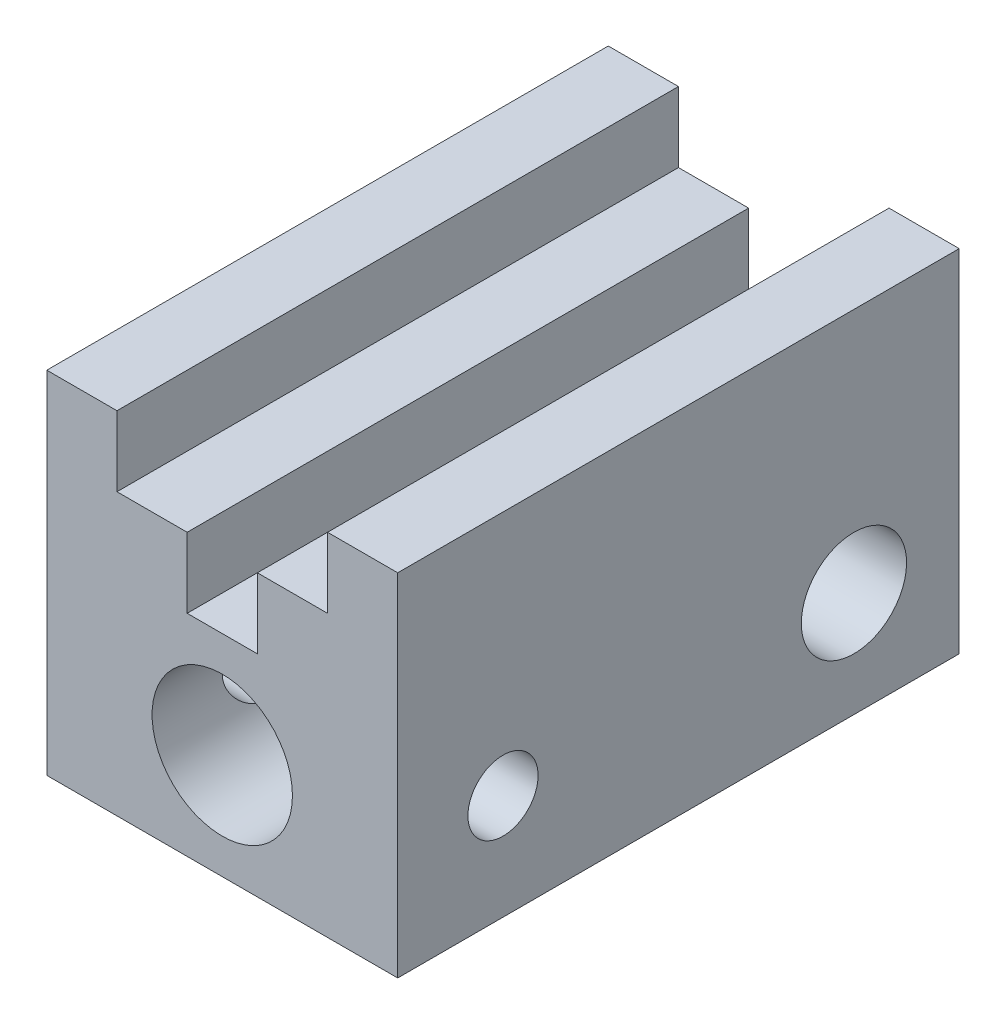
ISO-10303-21;
HEADER;
FILE_DESCRIPTION(('STEP AP214'),'2;1');
FILE_NAME('part.step','',(''),(''),'','','');
FILE_SCHEMA(('AUTOMOTIVE_DESIGN { 1 0 10303 214 1 1 1 1 }'));
ENDSEC;
DATA;
#1=APPLICATION_CONTEXT('core data for automotive mechanical design processes');
#2=APPLICATION_PROTOCOL_DEFINITION('international standard','automotive_design',2000,#1);
#3=PRODUCT_CONTEXT('',#1,'mechanical');
#4=PRODUCT('Part','Part','',(#3));
#5=PRODUCT_RELATED_PRODUCT_CATEGORY('part','',(#4));
#6=PRODUCT_DEFINITION_FORMATION('','',#4);
#7=PRODUCT_DEFINITION_CONTEXT('part definition',#1,'design');
#8=PRODUCT_DEFINITION('design','',#6,#7);
#9=PRODUCT_DEFINITION_SHAPE('','',#8);
#10=(LENGTH_UNIT() NAMED_UNIT(*) SI_UNIT(.MILLI.,.METRE.));
#11=(NAMED_UNIT(*) PLANE_ANGLE_UNIT() SI_UNIT($,.RADIAN.));
#12=(NAMED_UNIT(*) SI_UNIT($,.STERADIAN.) SOLID_ANGLE_UNIT());
#13=UNCERTAINTY_MEASURE_WITH_UNIT(LENGTH_MEASURE(1.E-05),#10,'distance_accuracy_value','');
#14=(GEOMETRIC_REPRESENTATION_CONTEXT(3) GLOBAL_UNCERTAINTY_ASSIGNED_CONTEXT((#13)) GLOBAL_UNIT_ASSIGNED_CONTEXT((#10,
#11,#12)) REPRESENTATION_CONTEXT('',''));
#15=CARTESIAN_POINT('',(0.,0.,0.));
#16=DIRECTION('',(0.,0.,1.));
#17=DIRECTION('',(1.,0.,0.));
#18=AXIS2_PLACEMENT_3D('',#15,#16,#17);
#19=CARTESIAN_POINT('',(-25.,50.,-80.));
#20=DIRECTION('',(-1.,0.,0.));
#21=DIRECTION('',(0.,-1.,0.));
#22=AXIS2_PLACEMENT_3D('',#19,#20,#21);
#23=PLANE('',#22);
#24=CARTESIAN_POINT('',(-25.,15.,-65.));
#25=DIRECTION('',(1.,0.,0.));
#26=DIRECTION('',(0.,1.,0.));
#27=AXIS2_PLACEMENT_3D('',#24,#25,#26);
#28=CIRCLE('',#27,7.50000000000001);
#29=CARTESIAN_POINT('',(-25.,22.5,-65.));
#30=VERTEX_POINT('',#29);
#31=EDGE_CURVE('E238',#30,#30,#28,.T.);
#32=ORIENTED_EDGE('',*,*,#31,.T.);
#33=EDGE_LOOP('',(#32));
#34=FACE_BOUND('',#33,.T.);
#35=CARTESIAN_POINT('',(-25.,15.,-15.));
#36=DIRECTION('',(1.,0.,0.));
#37=DIRECTION('',(0.,1.,0.));
#38=AXIS2_PLACEMENT_3D('',#35,#36,#37);
#39=CIRCLE('',#38,5.);
#40=CARTESIAN_POINT('',(-25.,20.,-15.));
#41=VERTEX_POINT('',#40);
#42=EDGE_CURVE('E216',#41,#41,#39,.T.);
#43=ORIENTED_EDGE('',*,*,#42,.T.);
#44=EDGE_LOOP('',(#43));
#45=FACE_BOUND('',#44,.T.);
#46=DIRECTION('',(0.,-1.,0.));
#47=VECTOR('',#46,1.);
#48=CARTESIAN_POINT('',(-25.,50.,0.));
#49=LINE('',#48,#47);
#50=CARTESIAN_POINT('',(-25.,50.,0.));
#51=VERTEX_POINT('',#50);
#52=CARTESIAN_POINT('',(-25.,0.,0.));
#53=VERTEX_POINT('',#52);
#54=EDGE_CURVE('E157',#51,#53,#49,.T.);
#55=ORIENTED_EDGE('',*,*,#54,.F.);
#56=DIRECTION('',(0.,0.,1.));
#57=VECTOR('',#56,1.);
#58=CARTESIAN_POINT('',(-25.,50.,-80.));
#59=LINE('',#58,#57);
#60=CARTESIAN_POINT('',(-25.,50.,-80.));
#61=VERTEX_POINT('',#60);
#62=EDGE_CURVE('E11',#61,#51,#59,.T.);
#63=ORIENTED_EDGE('',*,*,#62,.F.);
#64=DIRECTION('',(0.,-1.,0.));
#65=VECTOR('',#64,1.);
#66=CARTESIAN_POINT('',(-25.,50.,-80.));
#67=LINE('',#66,#65);
#68=CARTESIAN_POINT('',(-25.,0.,-80.));
#69=VERTEX_POINT('',#68);
#70=EDGE_CURVE('E190',#61,#69,#67,.T.);
#71=ORIENTED_EDGE('',*,*,#70,.T.);
#72=DIRECTION('',(0.,0.,1.));
#73=VECTOR('',#72,1.);
#74=CARTESIAN_POINT('',(-25.,0.,-80.));
#75=LINE('',#74,#73);
#76=EDGE_CURVE('E103',#69,#53,#75,.T.);
#77=ORIENTED_EDGE('',*,*,#76,.T.);
#78=EDGE_LOOP('',(#55,#63,#71,#77));
#79=FACE_BOUND('',#78,.T.);
#80=ADVANCED_FACE('F31',(#34,#45,#79),#23,.T.);
#81=CARTESIAN_POINT('',(-25.,50.,-80.));
#82=DIRECTION('',(0.,1.,0.));
#83=DIRECTION('',(0.,0.,1.));
#84=AXIS2_PLACEMENT_3D('',#81,#82,#83);
#85=PLANE('',#84);
#86=DIRECTION('',(-1.,0.,0.));
#87=VECTOR('',#86,1.);
#88=CARTESIAN_POINT('',(-25.,50.,0.));
#89=LINE('',#88,#87);
#90=CARTESIAN_POINT('',(-15.,50.,0.));
#91=VERTEX_POINT('',#90);
#92=EDGE_CURVE('E188',#91,#51,#89,.T.);
#93=ORIENTED_EDGE('',*,*,#92,.F.);
#94=DIRECTION('',(0.,0.,1.));
#95=VECTOR('',#94,1.);
#96=CARTESIAN_POINT('',(-15.,50.,-80.));
#97=LINE('',#96,#95);
#98=CARTESIAN_POINT('',(-15.,50.,-80.));
#99=VERTEX_POINT('',#98);
#100=EDGE_CURVE('E44',#99,#91,#97,.T.);
#101=ORIENTED_EDGE('',*,*,#100,.F.);
#102=DIRECTION('',(-1.,0.,0.));
#103=VECTOR('',#102,1.);
#104=CARTESIAN_POINT('',(-25.,50.,-80.));
#105=LINE('',#104,#103);
#106=EDGE_CURVE('E147',#99,#61,#105,.T.);
#107=ORIENTED_EDGE('',*,*,#106,.T.);
#108=ORIENTED_EDGE('',*,*,#62,.T.);
#109=EDGE_LOOP('',(#93,#101,#107,#108));
#110=FACE_BOUND('',#109,.T.);
#111=ADVANCED_FACE('F306',(#110),#85,.T.);
#112=CARTESIAN_POINT('',(-15.,50.,-80.));
#113=DIRECTION('',(1.,0.,0.));
#114=DIRECTION('',(0.,1.,0.));
#115=AXIS2_PLACEMENT_3D('',#112,#113,#114);
#116=PLANE('',#115);
#117=DIRECTION('',(0.,1.,0.));
#118=VECTOR('',#117,1.);
#119=CARTESIAN_POINT('',(-15.,50.,0.));
#120=LINE('',#119,#118);
#121=CARTESIAN_POINT('',(-15.,40.,0.));
#122=VERTEX_POINT('',#121);
#123=EDGE_CURVE('E134',#122,#91,#120,.T.);
#124=ORIENTED_EDGE('',*,*,#123,.F.);
#125=DIRECTION('',(0.,0.,1.));
#126=VECTOR('',#125,1.);
#127=CARTESIAN_POINT('',(-15.,40.,-80.));
#128=LINE('',#127,#126);
#129=CARTESIAN_POINT('',(-15.,40.,-80.));
#130=VERTEX_POINT('',#129);
#131=EDGE_CURVE('E129',#130,#122,#128,.T.);
#132=ORIENTED_EDGE('',*,*,#131,.F.);
#133=DIRECTION('',(0.,1.,0.));
#134=VECTOR('',#133,1.);
#135=CARTESIAN_POINT('',(-15.,50.,-80.));
#136=LINE('',#135,#134);
#137=EDGE_CURVE('E132',#130,#99,#136,.T.);
#138=ORIENTED_EDGE('',*,*,#137,.T.);
#139=ORIENTED_EDGE('',*,*,#100,.T.);
#140=EDGE_LOOP('',(#124,#132,#138,#139));
#141=FACE_BOUND('',#140,.T.);
#142=ADVANCED_FACE('F131',(#141),#116,.T.);
#143=CARTESIAN_POINT('',(-15.,40.,-80.));
#144=DIRECTION('',(0.,1.,0.));
#145=DIRECTION('',(0.,0.,1.));
#146=AXIS2_PLACEMENT_3D('',#143,#144,#145);
#147=PLANE('',#146);
#148=DIRECTION('',(-1.,0.,0.));
#149=VECTOR('',#148,1.);
#150=CARTESIAN_POINT('',(-15.,40.,0.));
#151=LINE('',#150,#149);
#152=CARTESIAN_POINT('',(-5.00000000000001,40.,0.));
#153=VERTEX_POINT('',#152);
#154=EDGE_CURVE('E185',#153,#122,#151,.T.);
#155=ORIENTED_EDGE('',*,*,#154,.F.);
#156=DIRECTION('',(0.,0.,1.));
#157=VECTOR('',#156,1.);
#158=CARTESIAN_POINT('',(-5.00000000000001,40.,-80.));
#159=LINE('',#158,#157);
#160=CARTESIAN_POINT('',(-5.00000000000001,40.,-80.));
#161=VERTEX_POINT('',#160);
#162=EDGE_CURVE('E139',#161,#153,#159,.T.);
#163=ORIENTED_EDGE('',*,*,#162,.F.);
#164=DIRECTION('',(-1.,0.,0.));
#165=VECTOR('',#164,1.);
#166=CARTESIAN_POINT('',(-15.,40.,-80.));
#167=LINE('',#166,#165);
#168=EDGE_CURVE('E145',#161,#130,#167,.T.);
#169=ORIENTED_EDGE('',*,*,#168,.T.);
#170=ORIENTED_EDGE('',*,*,#131,.T.);
#171=EDGE_LOOP('',(#155,#163,#169,#170));
#172=FACE_BOUND('',#171,.T.);
#173=ADVANCED_FACE('F149',(#172),#147,.T.);
#174=CARTESIAN_POINT('',(-5.00000000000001,40.,-80.));
#175=DIRECTION('',(1.,0.,0.));
#176=DIRECTION('',(0.,0.,-1.));
#177=AXIS2_PLACEMENT_3D('',#174,#175,#176);
#178=PLANE('',#177);
#179=DIRECTION('',(0.,1.,0.));
#180=VECTOR('',#179,1.);
#181=CARTESIAN_POINT('',(-5.00000000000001,40.,0.));
#182=LINE('',#181,#180);
#183=CARTESIAN_POINT('',(-5.00000000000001,30.,0.));
#184=VERTEX_POINT('',#183);
#185=EDGE_CURVE('E182',#184,#153,#182,.T.);
#186=ORIENTED_EDGE('',*,*,#185,.F.);
#187=DIRECTION('',(0.,0.,1.));
#188=VECTOR('',#187,1.);
#189=CARTESIAN_POINT('',(-5.00000000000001,30.,-80.));
#190=LINE('',#189,#188);
#191=CARTESIAN_POINT('',(-5.00000000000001,30.,-80.));
#192=VERTEX_POINT('',#191);
#193=EDGE_CURVE('E194',#192,#184,#190,.T.);
#194=ORIENTED_EDGE('',*,*,#193,.F.);
#195=DIRECTION('',(0.,1.,0.));
#196=VECTOR('',#195,1.);
#197=CARTESIAN_POINT('',(-5.00000000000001,40.,-80.));
#198=LINE('',#197,#196);
#199=EDGE_CURVE('E150',#192,#161,#198,.T.);
#200=ORIENTED_EDGE('',*,*,#199,.T.);
#201=ORIENTED_EDGE('',*,*,#162,.T.);
#202=EDGE_LOOP('',(#186,#194,#200,#201));
#203=FACE_BOUND('',#202,.T.);
#204=ADVANCED_FACE('F318',(#203),#178,.T.);
#205=CARTESIAN_POINT('',(-5.00000000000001,30.,-80.));
#206=DIRECTION('',(0.,1.,0.));
#207=DIRECTION('',(-1.,0.,0.));
#208=AXIS2_PLACEMENT_3D('',#205,#206,#207);
#209=PLANE('',#208);
#210=DIRECTION('',(-1.,0.,0.));
#211=VECTOR('',#210,1.);
#212=CARTESIAN_POINT('',(-5.00000000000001,30.,0.));
#213=LINE('',#212,#211);
#214=CARTESIAN_POINT('',(4.99999999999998,30.,0.));
#215=VERTEX_POINT('',#214);
#216=EDGE_CURVE('E179',#215,#184,#213,.T.);
#217=ORIENTED_EDGE('',*,*,#216,.F.);
#218=DIRECTION('',(0.,0.,1.));
#219=VECTOR('',#218,1.);
#220=CARTESIAN_POINT('',(4.99999999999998,30.,-80.));
#221=LINE('',#220,#219);
#222=CARTESIAN_POINT('',(4.99999999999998,30.,-80.));
#223=VERTEX_POINT('',#222);
#224=EDGE_CURVE('E196',#223,#215,#221,.T.);
#225=ORIENTED_EDGE('',*,*,#224,.F.);
#226=DIRECTION('',(-1.,0.,0.));
#227=VECTOR('',#226,1.);
#228=CARTESIAN_POINT('',(-5.00000000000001,30.,-80.));
#229=LINE('',#228,#227);
#230=EDGE_CURVE('E152',#223,#192,#229,.T.);
#231=ORIENTED_EDGE('',*,*,#230,.T.);
#232=ORIENTED_EDGE('',*,*,#193,.T.);
#233=EDGE_LOOP('',(#217,#225,#231,#232));
#234=FACE_BOUND('',#233,.T.);
#235=ADVANCED_FACE('F281',(#234),#209,.T.);
#236=CARTESIAN_POINT('',(4.99999999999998,30.,-80.));
#237=DIRECTION('',(-1.,0.,0.));
#238=DIRECTION('',(0.,-1.,0.));
#239=AXIS2_PLACEMENT_3D('',#236,#237,#238);
#240=PLANE('',#239);
#241=DIRECTION('',(0.,-1.,0.));
#242=VECTOR('',#241,1.);
#243=CARTESIAN_POINT('',(4.99999999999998,30.,0.));
#244=LINE('',#243,#242);
#245=CARTESIAN_POINT('',(4.99999999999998,40.,0.));
#246=VERTEX_POINT('',#245);
#247=EDGE_CURVE('E176',#246,#215,#244,.T.);
#248=ORIENTED_EDGE('',*,*,#247,.F.);
#249=DIRECTION('',(0.,0.,1.));
#250=VECTOR('',#249,1.);
#251=CARTESIAN_POINT('',(4.99999999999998,40.,-80.));
#252=LINE('',#251,#250);
#253=CARTESIAN_POINT('',(4.99999999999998,40.,-80.));
#254=VERTEX_POINT('',#253);
#255=EDGE_CURVE('E198',#254,#246,#252,.T.);
#256=ORIENTED_EDGE('',*,*,#255,.F.);
#257=DIRECTION('',(0.,-1.,0.));
#258=VECTOR('',#257,1.);
#259=CARTESIAN_POINT('',(4.99999999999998,30.,-80.));
#260=LINE('',#259,#258);
#261=EDGE_CURVE('E275',#254,#223,#260,.T.);
#262=ORIENTED_EDGE('',*,*,#261,.T.);
#263=ORIENTED_EDGE('',*,*,#224,.T.);
#264=EDGE_LOOP('',(#248,#256,#262,#263));
#265=FACE_BOUND('',#264,.T.);
#266=ADVANCED_FACE('F287',(#265),#240,.T.);
#267=CARTESIAN_POINT('',(4.99999999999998,40.,-80.));
#268=DIRECTION('',(0.,1.,0.));
#269=DIRECTION('',(-1.,0.,0.));
#270=AXIS2_PLACEMENT_3D('',#267,#268,#269);
#271=PLANE('',#270);
#272=DIRECTION('',(-1.,0.,0.));
#273=VECTOR('',#272,1.);
#274=CARTESIAN_POINT('',(4.99999999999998,40.,0.));
#275=LINE('',#274,#273);
#276=CARTESIAN_POINT('',(15.,40.,0.));
#277=VERTEX_POINT('',#276);
#278=EDGE_CURVE('E173',#277,#246,#275,.T.);
#279=ORIENTED_EDGE('',*,*,#278,.F.);
#280=DIRECTION('',(0.,0.,1.));
#281=VECTOR('',#280,1.);
#282=CARTESIAN_POINT('',(15.,40.,-80.));
#283=LINE('',#282,#281);
#284=CARTESIAN_POINT('',(15.,40.,-80.));
#285=VERTEX_POINT('',#284);
#286=EDGE_CURVE('E200',#285,#277,#283,.T.);
#287=ORIENTED_EDGE('',*,*,#286,.F.);
#288=DIRECTION('',(-1.,0.,0.));
#289=VECTOR('',#288,1.);
#290=CARTESIAN_POINT('',(4.99999999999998,40.,-80.));
#291=LINE('',#290,#289);
#292=EDGE_CURVE('E272',#285,#254,#291,.T.);
#293=ORIENTED_EDGE('',*,*,#292,.T.);
#294=ORIENTED_EDGE('',*,*,#255,.T.);
#295=EDGE_LOOP('',(#279,#287,#293,#294));
#296=FACE_BOUND('',#295,.T.);
#297=ADVANCED_FACE('F290',(#296),#271,.T.);
#298=CARTESIAN_POINT('',(15.,40.,-80.));
#299=DIRECTION('',(-1.,0.,0.));
#300=DIRECTION('',(0.,-1.,0.));
#301=AXIS2_PLACEMENT_3D('',#298,#299,#300);
#302=PLANE('',#301);
#303=DIRECTION('',(0.,-1.,0.));
#304=VECTOR('',#303,1.);
#305=CARTESIAN_POINT('',(15.,40.,0.));
#306=LINE('',#305,#304);
#307=CARTESIAN_POINT('',(15.,50.,0.));
#308=VERTEX_POINT('',#307);
#309=EDGE_CURVE('E170',#308,#277,#306,.T.);
#310=ORIENTED_EDGE('',*,*,#309,.F.);
#311=DIRECTION('',(0.,0.,1.));
#312=VECTOR('',#311,1.);
#313=CARTESIAN_POINT('',(15.,50.,-80.));
#314=LINE('',#313,#312);
#315=CARTESIAN_POINT('',(15.,50.,-80.));
#316=VERTEX_POINT('',#315);
#317=EDGE_CURVE('E202',#316,#308,#314,.T.);
#318=ORIENTED_EDGE('',*,*,#317,.F.);
#319=DIRECTION('',(0.,-1.,0.));
#320=VECTOR('',#319,1.);
#321=CARTESIAN_POINT('',(15.,40.,-80.));
#322=LINE('',#321,#320);
#323=EDGE_CURVE('E269',#316,#285,#322,.T.);
#324=ORIENTED_EDGE('',*,*,#323,.T.);
#325=ORIENTED_EDGE('',*,*,#286,.T.);
#326=EDGE_LOOP('',(#310,#318,#324,#325));
#327=FACE_BOUND('',#326,.T.);
#328=ADVANCED_FACE('F295',(#327),#302,.T.);
#329=CARTESIAN_POINT('',(15.,50.,-80.));
#330=DIRECTION('',(0.,1.,0.));
#331=DIRECTION('',(-1.,0.,0.));
#332=AXIS2_PLACEMENT_3D('',#329,#330,#331);
#333=PLANE('',#332);
#334=DIRECTION('',(-1.,0.,0.));
#335=VECTOR('',#334,1.);
#336=CARTESIAN_POINT('',(15.,50.,0.));
#337=LINE('',#336,#335);
#338=CARTESIAN_POINT('',(25.,50.,0.));
#339=VERTEX_POINT('',#338);
#340=EDGE_CURVE('E167',#339,#308,#337,.T.);
#341=ORIENTED_EDGE('',*,*,#340,.F.);
#342=DIRECTION('',(0.,0.,1.));
#343=VECTOR('',#342,1.);
#344=CARTESIAN_POINT('',(25.,50.,-80.));
#345=LINE('',#344,#343);
#346=CARTESIAN_POINT('',(25.,50.,-80.));
#347=VERTEX_POINT('',#346);
#348=EDGE_CURVE('E204',#347,#339,#345,.T.);
#349=ORIENTED_EDGE('',*,*,#348,.F.);
#350=DIRECTION('',(-1.,0.,0.));
#351=VECTOR('',#350,1.);
#352=CARTESIAN_POINT('',(15.,50.,-80.));
#353=LINE('',#352,#351);
#354=EDGE_CURVE('E266',#347,#316,#353,.T.);
#355=ORIENTED_EDGE('',*,*,#354,.T.);
#356=ORIENTED_EDGE('',*,*,#317,.T.);
#357=EDGE_LOOP('',(#341,#349,#355,#356));
#358=FACE_BOUND('',#357,.T.);
#359=ADVANCED_FACE('F298',(#358),#333,.T.);
#360=CARTESIAN_POINT('',(25.,50.,-80.));
#361=DIRECTION('',(1.,0.,0.));
#362=DIRECTION('',(0.,1.,0.));
#363=AXIS2_PLACEMENT_3D('',#360,#361,#362);
#364=PLANE('',#363);
#365=CARTESIAN_POINT('',(25.,15.,-65.));
#366=DIRECTION('',(1.,0.,0.));
#367=DIRECTION('',(0.,1.,0.));
#368=AXIS2_PLACEMENT_3D('',#365,#366,#367);
#369=CIRCLE('',#368,7.50000000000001);
#370=CARTESIAN_POINT('',(25.,22.5,-65.));
#371=VERTEX_POINT('',#370);
#372=EDGE_CURVE('E244',#371,#371,#369,.T.);
#373=ORIENTED_EDGE('',*,*,#372,.F.);
#374=EDGE_LOOP('',(#373));
#375=FACE_BOUND('',#374,.T.);
#376=CARTESIAN_POINT('',(25.,15.,-15.));
#377=DIRECTION('',(1.,0.,0.));
#378=DIRECTION('',(0.,1.,0.));
#379=AXIS2_PLACEMENT_3D('',#376,#377,#378);
#380=CIRCLE('',#379,5.);
#381=CARTESIAN_POINT('',(25.,20.,-15.));
#382=VERTEX_POINT('',#381);
#383=EDGE_CURVE('E242',#382,#382,#380,.T.);
#384=ORIENTED_EDGE('',*,*,#383,.F.);
#385=EDGE_LOOP('',(#384));
#386=FACE_BOUND('',#385,.T.);
#387=DIRECTION('',(0.,1.,0.));
#388=VECTOR('',#387,1.);
#389=CARTESIAN_POINT('',(25.,50.,0.));
#390=LINE('',#389,#388);
#391=CARTESIAN_POINT('',(25.,0.,0.));
#392=VERTEX_POINT('',#391);
#393=EDGE_CURVE('E164',#392,#339,#390,.T.);
#394=ORIENTED_EDGE('',*,*,#393,.F.);
#395=DIRECTION('',(0.,0.,1.));
#396=VECTOR('',#395,1.);
#397=CARTESIAN_POINT('',(25.,0.,-80.));
#398=LINE('',#397,#396);
#399=CARTESIAN_POINT('',(25.,0.,-80.));
#400=VERTEX_POINT('',#399);
#401=EDGE_CURVE('E206',#400,#392,#398,.T.);
#402=ORIENTED_EDGE('',*,*,#401,.F.);
#403=DIRECTION('',(0.,1.,0.));
#404=VECTOR('',#403,1.);
#405=CARTESIAN_POINT('',(25.,50.,-80.));
#406=LINE('',#405,#404);
#407=EDGE_CURVE('E263',#400,#347,#406,.T.);
#408=ORIENTED_EDGE('',*,*,#407,.T.);
#409=ORIENTED_EDGE('',*,*,#348,.T.);
#410=EDGE_LOOP('',(#394,#402,#408,#409));
#411=FACE_BOUND('',#410,.T.);
#412=ADVANCED_FACE('F302',(#375,#386,#411),#364,.T.);
#413=CARTESIAN_POINT('',(-25.,0.,-80.));
#414=DIRECTION('',(0.,-1.,0.));
#415=DIRECTION('',(0.,0.,-1.));
#416=AXIS2_PLACEMENT_3D('',#413,#414,#415);
#417=PLANE('',#416);
#418=DIRECTION('',(1.,0.,0.));
#419=VECTOR('',#418,1.);
#420=CARTESIAN_POINT('',(-25.,0.,0.));
#421=LINE('',#420,#419);
#422=EDGE_CURVE('E160',#53,#392,#421,.T.);
#423=ORIENTED_EDGE('',*,*,#422,.F.);
#424=ORIENTED_EDGE('',*,*,#76,.F.);
#425=DIRECTION('',(1.,0.,0.));
#426=VECTOR('',#425,1.);
#427=CARTESIAN_POINT('',(-25.,0.,-80.));
#428=LINE('',#427,#426);
#429=EDGE_CURVE('E261',#69,#400,#428,.T.);
#430=ORIENTED_EDGE('',*,*,#429,.T.);
#431=ORIENTED_EDGE('',*,*,#401,.T.);
#432=EDGE_LOOP('',(#423,#424,#430,#431));
#433=FACE_BOUND('',#432,.T.);
#434=ADVANCED_FACE('F303',(#433),#417,.T.);
#435=CARTESIAN_POINT('',(-25.,0.,-80.));
#436=DIRECTION('',(0.,0.,1.));
#437=DIRECTION('',(1.,0.,0.));
#438=AXIS2_PLACEMENT_3D('',#435,#436,#437);
#439=PLANE('',#438);
#440=CARTESIAN_POINT('',(0.,15.,-80.));
#441=DIRECTION('',(0.,0.,1.));
#442=DIRECTION('',(1.,0.,0.));
#443=AXIS2_PLACEMENT_3D('',#440,#441,#442);
#444=CIRCLE('',#443,10.);
#445=CARTESIAN_POINT('',(10.,15.,-80.));
#446=VERTEX_POINT('',#445);
#447=EDGE_CURVE('E161',#446,#446,#444,.T.);
#448=ORIENTED_EDGE('',*,*,#447,.T.);
#449=EDGE_LOOP('',(#448));
#450=FACE_BOUND('',#449,.T.);
#451=ORIENTED_EDGE('',*,*,#70,.F.);
#452=ORIENTED_EDGE('',*,*,#106,.F.);
#453=ORIENTED_EDGE('',*,*,#137,.F.);
#454=ORIENTED_EDGE('',*,*,#168,.F.);
#455=ORIENTED_EDGE('',*,*,#199,.F.);
#456=ORIENTED_EDGE('',*,*,#230,.F.);
#457=ORIENTED_EDGE('',*,*,#261,.F.);
#458=ORIENTED_EDGE('',*,*,#292,.F.);
#459=ORIENTED_EDGE('',*,*,#323,.F.);
#460=ORIENTED_EDGE('',*,*,#354,.F.);
#461=ORIENTED_EDGE('',*,*,#407,.F.);
#462=ORIENTED_EDGE('',*,*,#429,.F.);
#463=EDGE_LOOP('',(#451,#452,#453,#454,#455,#456,#457,#458,#459,#460,#461,#462));
#464=FACE_BOUND('',#463,.T.);
#465=ADVANCED_FACE('F143',(#450,#464),#439,.F.);
#466=CARTESIAN_POINT('',(-25.,0.,0.));
#467=DIRECTION('',(0.,0.,1.));
#468=DIRECTION('',(1.,0.,0.));
#469=AXIS2_PLACEMENT_3D('',#466,#467,#468);
#470=PLANE('',#469);
#471=CARTESIAN_POINT('',(0.,15.,0.));
#472=DIRECTION('',(0.,0.,1.));
#473=DIRECTION('',(1.,0.,0.));
#474=AXIS2_PLACEMENT_3D('',#471,#472,#473);
#475=CIRCLE('',#474,10.);
#476=CARTESIAN_POINT('',(10.,15.,0.));
#477=VERTEX_POINT('',#476);
#478=EDGE_CURVE('E257',#477,#477,#475,.T.);
#479=ORIENTED_EDGE('',*,*,#478,.F.);
#480=EDGE_LOOP('',(#479));
#481=FACE_BOUND('',#480,.T.);
#482=ORIENTED_EDGE('',*,*,#54,.T.);
#483=ORIENTED_EDGE('',*,*,#422,.T.);
#484=ORIENTED_EDGE('',*,*,#393,.T.);
#485=ORIENTED_EDGE('',*,*,#340,.T.);
#486=ORIENTED_EDGE('',*,*,#309,.T.);
#487=ORIENTED_EDGE('',*,*,#278,.T.);
#488=ORIENTED_EDGE('',*,*,#247,.T.);
#489=ORIENTED_EDGE('',*,*,#216,.T.);
#490=ORIENTED_EDGE('',*,*,#185,.T.);
#491=ORIENTED_EDGE('',*,*,#154,.T.);
#492=ORIENTED_EDGE('',*,*,#123,.T.);
#493=ORIENTED_EDGE('',*,*,#92,.T.);
#494=EDGE_LOOP('',(#482,#483,#484,#485,#486,#487,#488,#489,#490,#491,#492,#493));
#495=FACE_BOUND('',#494,.T.);
#496=ADVANCED_FACE('F305',(#481,#495),#470,.T.);
#497=CARTESIAN_POINT('',(0.,15.,-80.));
#498=DIRECTION('',(0.,0.,1.));
#499=DIRECTION('',(1.,0.,0.));
#500=AXIS2_PLACEMENT_3D('',#497,#498,#499);
#501=CYLINDRICAL_SURFACE('',#500,10.);
#502=CARTESIAN_POINT('',(10.,15.,-72.5));
#503=CARTESIAN_POINT('',(9.99999825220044,15.1831483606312,-72.4999981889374));
#504=CARTESIAN_POINT('',(9.99495621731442,15.3663425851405,-72.4932790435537));
#505=CARTESIAN_POINT('',(9.97490143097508,15.7312846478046,-72.4665075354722));
#506=CARTESIAN_POINT('',(9.95988271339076,15.9130315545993,-72.4464471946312));
#507=CARTESIAN_POINT('',(9.9201917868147,16.2738927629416,-72.3932752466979));
#508=CARTESIAN_POINT('',(9.89550118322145,16.4530013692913,-72.3601387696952));
#509=CARTESIAN_POINT('',(9.83702172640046,16.8069893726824,-72.2813249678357));
#510=CARTESIAN_POINT('',(9.80322881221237,16.981866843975,-72.2356420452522));
#511=CARTESIAN_POINT('',(9.72752378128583,17.3250699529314,-72.1327363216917));
#512=CARTESIAN_POINT('',(9.68566656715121,17.493431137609,-72.0755914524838));
#513=CARTESIAN_POINT('',(9.59451489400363,17.8239557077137,-71.9502916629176));
#514=CARTESIAN_POINT('',(9.5452174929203,17.9861166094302,-71.8821323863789));
#515=CARTESIAN_POINT('',(9.38756843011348,18.4619240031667,-71.6623521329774));
#516=CARTESIAN_POINT('',(9.2693577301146,18.7653421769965,-71.4952921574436));
#517=CARTESIAN_POINT('',(9.00247083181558,19.3673803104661,-71.1086707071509));
#518=CARTESIAN_POINT('',(8.85198712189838,19.6629539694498,-70.885680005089));
#519=CARTESIAN_POINT('',(8.53832916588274,20.215148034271,-70.4025041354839));
#520=CARTESIAN_POINT('',(8.37513550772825,20.4717070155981,-70.1422615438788));
#521=CARTESIAN_POINT('',(8.1123054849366,20.849832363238,-69.6986607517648));
#522=CARTESIAN_POINT('',(8.01322272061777,20.9844869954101,-69.5259238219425));
#523=CARTESIAN_POINT('',(7.81692237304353,21.2387084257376,-69.1685280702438));
#524=CARTESIAN_POINT('',(7.71970535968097,21.3582706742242,-68.9838656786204));
#525=CARTESIAN_POINT('',(7.53024443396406,21.5815527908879,-68.603028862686));
#526=CARTESIAN_POINT('',(7.43799561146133,21.685288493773,-68.4068662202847));
#527=CARTESIAN_POINT('',(7.2619499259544,21.8761126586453,-68.0031570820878));
#528=CARTESIAN_POINT('',(7.1781482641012,21.9632105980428,-67.7956171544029));
#529=CARTESIAN_POINT('',(6.99885956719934,22.1440087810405,-67.3025464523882));
#530=CARTESIAN_POINT('',(6.90787299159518,22.2313037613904,-67.0128709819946));
#531=CARTESIAN_POINT('',(6.79582705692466,22.3361674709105,-66.5665302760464));
#532=CARTESIAN_POINT('',(6.76256264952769,22.3667656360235,-66.4158673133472));
#533=CARTESIAN_POINT('',(6.70541097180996,22.4188248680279,-66.1112483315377));
#534=CARTESIAN_POINT('',(6.68151886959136,22.4402906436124,-65.9572940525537));
#535=CARTESIAN_POINT('',(6.6439948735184,22.4738195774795,-65.6456153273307));
#536=CARTESIAN_POINT('',(6.63046224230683,22.4857918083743,-65.4878689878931));
#537=CARTESIAN_POINT('',(6.61471013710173,22.4997148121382,-65.1713664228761));
#538=CARTESIAN_POINT('',(6.61249035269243,22.5016658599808,-65.0126102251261));
#539=CARTESIAN_POINT('',(6.61948621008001,22.4954937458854,-64.6954929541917));
#540=CARTESIAN_POINT('',(6.62870559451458,22.4873672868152,-64.5371320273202));
#541=CARTESIAN_POINT('',(6.65809333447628,22.4612438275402,-64.2222932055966));
#542=CARTESIAN_POINT('',(6.67826180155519,22.4432467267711,-64.065815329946));
#543=CARTESIAN_POINT('',(6.74840995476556,22.3798863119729,-63.6342503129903));
#544=CARTESIAN_POINT('',(6.80936438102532,22.3241301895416,-63.3623944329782));
#545=CARTESIAN_POINT('',(6.95570310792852,22.1852776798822,-62.8327292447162));
#546=CARTESIAN_POINT('',(7.04111087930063,22.1021550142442,-62.5749337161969));
#547=CARTESIAN_POINT('',(7.21099153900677,21.9291738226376,-62.1218305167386));
#548=CARTESIAN_POINT('',(7.29266351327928,21.8434683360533,-61.9238405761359));
#549=CARTESIAN_POINT('',(7.46342165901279,21.6568261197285,-61.5384190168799));
#550=CARTESIAN_POINT('',(7.55251162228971,21.5558815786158,-61.3509928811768));
#551=CARTESIAN_POINT('',(7.73517823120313,21.3393322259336,-60.9865361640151));
#552=CARTESIAN_POINT('',(7.82876380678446,21.2236974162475,-60.8095279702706));
#553=CARTESIAN_POINT('',(8.01761553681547,20.9784442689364,-60.4664971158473));
#554=CARTESIAN_POINT('',(8.11288142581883,20.848828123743,-60.3004727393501));
#555=CARTESIAN_POINT('',(8.30521453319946,20.5724740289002,-59.975645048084));
#556=CARTESIAN_POINT('',(8.40226649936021,20.4253863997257,-59.8171299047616));
#557=CARTESIAN_POINT('',(8.5935031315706,20.1170902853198,-59.5125287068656));
#558=CARTESIAN_POINT('',(8.68768750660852,19.9558803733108,-59.3664439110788));
#559=CARTESIAN_POINT('',(8.87089324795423,19.6199350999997,-59.0878314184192));
#560=CARTESIAN_POINT('',(8.9599230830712,19.445223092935,-58.9552811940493));
#561=CARTESIAN_POINT('',(9.13090472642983,19.0824934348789,-58.7046195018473));
#562=CARTESIAN_POINT('',(9.21285834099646,18.8944792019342,-58.5865043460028));
#563=CARTESIAN_POINT('',(9.35211813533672,18.5448353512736,-58.3881893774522));
#564=CARTESIAN_POINT('',(9.41107137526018,18.3854749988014,-58.3051360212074));
#565=CARTESIAN_POINT('',(9.52211460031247,18.0592491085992,-58.1499191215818));
#566=CARTESIAN_POINT('',(9.57420599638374,17.8923851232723,-58.0777533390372));
#567=CARTESIAN_POINT('',(9.67052015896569,17.5519252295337,-57.9451409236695));
#568=CARTESIAN_POINT('',(9.71474587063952,17.378331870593,-57.8846899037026));
#569=CARTESIAN_POINT('',(9.79443033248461,17.0253079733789,-57.7762740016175));
#570=CARTESIAN_POINT('',(9.82988897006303,16.8458773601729,-57.7283092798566));
#571=CARTESIAN_POINT('',(9.89142668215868,16.4812400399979,-57.6453346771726));
#572=CARTESIAN_POINT('',(9.91744578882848,16.2960042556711,-57.6104075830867));
#573=CARTESIAN_POINT('',(9.95915423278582,15.9222769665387,-57.554524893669));
#574=CARTESIAN_POINT('',(9.97484354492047,15.7337854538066,-57.5335693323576));
#575=CARTESIAN_POINT('',(9.99548555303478,15.355230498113,-57.5060147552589));
#576=CARTESIAN_POINT('',(10.0004418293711,15.1651676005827,-57.4994109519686));
#577=CARTESIAN_POINT('',(9.99949640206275,14.7851258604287,-57.5006714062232));
#578=CARTESIAN_POINT('',(9.99359555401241,14.5951470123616,-57.5085345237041));
#579=CARTESIAN_POINT('',(9.97223305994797,14.2360718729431,-57.5370576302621));
#580=CARTESIAN_POINT('',(9.95779618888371,14.0668026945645,-57.5563463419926));
#581=CARTESIAN_POINT('',(9.92057133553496,13.7308111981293,-57.606218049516));
#582=CARTESIAN_POINT('',(9.89778056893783,13.5640897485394,-57.6368048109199));
#583=CARTESIAN_POINT('',(9.84430767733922,13.2343556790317,-57.7088426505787));
#584=CARTESIAN_POINT('',(9.81362747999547,13.0713421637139,-57.7502910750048));
#585=CARTESIAN_POINT('',(9.74493618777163,12.7498317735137,-57.8435500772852));
#586=CARTESIAN_POINT('',(9.70692222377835,12.5913366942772,-57.8953647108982));
#587=CARTESIAN_POINT('',(9.62279034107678,12.2742457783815,-58.0107433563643));
#588=CARTESIAN_POINT('',(9.57643622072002,12.1158388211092,-58.0746538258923));
#589=CARTESIAN_POINT('',(9.47738924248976,11.805367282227,-58.2122770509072));
#590=CARTESIAN_POINT('',(9.42469423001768,11.6533048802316,-58.285993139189));
#591=CARTESIAN_POINT('',(9.25839398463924,11.2075633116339,-58.5207930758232));
#592=CARTESIAN_POINT('',(9.13650809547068,10.9240905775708,-58.6956169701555));
#593=CARTESIAN_POINT('',(8.855926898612,10.3423669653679,-59.1089611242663));
#594=CARTESIAN_POINT('',(8.69448369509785,10.0495539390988,-59.3532430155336));
#595=CARTESIAN_POINT('',(8.44516881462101,9.64232892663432,-59.7482147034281));
#596=CARTESIAN_POINT('',(8.36074234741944,9.51175081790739,-59.8848527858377));
#597=CARTESIAN_POINT('',(8.19100904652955,9.26151654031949,-60.1672592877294));
#598=CARTESIAN_POINT('',(8.1057024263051,9.14185778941,-60.3130255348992));
#599=CARTESIAN_POINT('',(7.91961196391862,8.89193855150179,-60.6420163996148));
#600=CARTESIAN_POINT('',(7.81897317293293,8.76399607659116,-60.8270894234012));
#601=CARTESIAN_POINT('',(7.62168627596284,8.5243543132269,-61.2096220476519));
#602=CARTESIAN_POINT('',(7.52503964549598,8.41266099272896,-61.4070861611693));
#603=CARTESIAN_POINT('',(7.33958950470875,8.20665141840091,-61.8137398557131));
#604=CARTESIAN_POINT('',(7.25076782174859,8.11229431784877,-62.0229003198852));
#605=CARTESIAN_POINT('',(7.08503810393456,7.94192967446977,-62.453031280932));
#606=CARTESIAN_POINT('',(7.0081202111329,7.86590691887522,-62.6739917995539));
#607=CARTESIAN_POINT('',(6.89776536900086,7.7595426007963,-63.0387365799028));
#608=CARTESIAN_POINT('',(6.85905105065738,7.72293277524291,-63.179121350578));
#609=CARTESIAN_POINT('',(6.789092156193,7.65762171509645,-63.463526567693));
#610=CARTESIAN_POINT('',(6.75784495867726,7.62891770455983,-63.6075457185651));
#611=CARTESIAN_POINT('',(6.70397772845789,7.57989133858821,-63.8983271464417));
#612=CARTESIAN_POINT('',(6.68134175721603,7.55955349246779,-64.0450838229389));
#613=CARTESIAN_POINT('',(6.64553659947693,7.52755566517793,-64.3407022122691));
#614=CARTESIAN_POINT('',(6.63236743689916,7.51589570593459,-64.48956393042));
#615=CARTESIAN_POINT('',(6.6160439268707,7.50146112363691,-64.7890456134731));
#616=CARTESIAN_POINT('',(6.61294157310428,7.49873262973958,-64.9396706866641));
#617=CARTESIAN_POINT('',(6.61704410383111,7.50235144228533,-65.2406650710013));
#618=CARTESIAN_POINT('',(6.6242487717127,7.508698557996,-65.391034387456));
#619=CARTESIAN_POINT('',(6.64864042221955,7.53033849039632,-65.6904403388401));
#620=CARTESIAN_POINT('',(6.66583653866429,7.54563949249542,-65.8394756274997));
#621=CARTESIAN_POINT('',(6.70947271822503,7.58489171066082,-66.1350870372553));
#622=CARTESIAN_POINT('',(6.73591768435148,7.60884751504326,-66.281661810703));
#623=CARTESIAN_POINT('',(6.80366991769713,7.67111006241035,-66.6030185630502));
#624=CARTESIAN_POINT('',(6.84695911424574,7.71140533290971,-66.7769975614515));
#625=CARTESIAN_POINT('',(6.94360749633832,7.80342043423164,-67.1191194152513));
#626=CARTESIAN_POINT('',(6.99697427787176,7.85514888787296,-67.2872577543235));
#627=CARTESIAN_POINT('',(7.11173285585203,7.96936582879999,-67.6173948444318));
#628=CARTESIAN_POINT('',(7.17314049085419,8.03187563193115,-67.7793806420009));
#629=CARTESIAN_POINT('',(7.30189696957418,8.16691824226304,-68.0965626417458));
#630=CARTESIAN_POINT('',(7.36924400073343,8.23944799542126,-68.2517608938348));
#631=CARTESIAN_POINT('',(7.53227527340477,8.420911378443,-68.6080855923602));
#632=CARTESIAN_POINT('',(7.62967949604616,8.53374100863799,-68.8064489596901));
#633=CARTESIAN_POINT('',(7.8284879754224,8.77590602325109,-69.1907343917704));
#634=CARTESIAN_POINT('',(7.92989347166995,8.9052465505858,-69.3766525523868));
#635=CARTESIAN_POINT('',(8.13368678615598,9.17999833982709,-69.7358998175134));
#636=CARTESIAN_POINT('',(8.23607528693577,9.32542163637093,-69.9092193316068));
#637=CARTESIAN_POINT('',(8.43902615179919,9.63188883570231,-70.2425789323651));
#638=CARTESIAN_POINT('',(8.53958873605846,9.79293084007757,-70.4026206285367));
#639=CARTESIAN_POINT('',(8.73722404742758,10.1317655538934,-70.7099065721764));
#640=CARTESIAN_POINT('',(8.83426032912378,10.3096877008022,-70.8570319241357));
#641=CARTESIAN_POINT('',(9.02148209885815,10.6807361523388,-71.1357799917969));
#642=CARTESIAN_POINT('',(9.11166669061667,10.8738644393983,-71.2674006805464));
#643=CARTESIAN_POINT('',(9.28256253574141,11.2742357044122,-71.5133531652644));
#644=CARTESIAN_POINT('',(9.36329167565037,11.4814508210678,-71.6277177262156));
#645=CARTESIAN_POINT('',(9.51304471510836,11.9091676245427,-71.8376480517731));
#646=CARTESIAN_POINT('',(9.58207465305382,12.129662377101,-71.9332235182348));
#647=CARTESIAN_POINT('',(9.68796526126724,12.515875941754,-72.0787264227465));
#648=CARTESIAN_POINT('',(9.72832482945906,12.6787099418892,-72.1338229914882));
#649=CARTESIAN_POINT('',(9.801325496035,13.0093579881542,-72.2330570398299));
#650=CARTESIAN_POINT('',(9.8339684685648,13.1771708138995,-72.2771971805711));
#651=CARTESIAN_POINT('',(9.89082818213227,13.5164116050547,-72.3538520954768));
#652=CARTESIAN_POINT('',(9.91506439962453,13.6878302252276,-72.3863937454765));
#653=CARTESIAN_POINT('',(9.95469855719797,14.033459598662,-72.4395119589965));
#654=CARTESIAN_POINT('',(9.97010101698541,14.2076688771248,-72.460094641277));
#655=CARTESIAN_POINT('',(9.98726751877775,14.485164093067,-72.483016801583));
#656=CARTESIAN_POINT('',(9.9920379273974,14.5879550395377,-72.4893811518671));
#657=CARTESIAN_POINT('',(9.99840491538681,14.793825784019,-72.4978736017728));
#658=CARTESIAN_POINT('',(10.0000009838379,14.8969056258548,-72.5000010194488));
#659=CARTESIAN_POINT('',(10.,15.,-72.5));
#660=B_SPLINE_CURVE_WITH_KNOTS('',3,(#502,#503,#504,#505,#506,#507,#508,#509,#510,#511,#512,
#513,#514,#515,#516,#517,#518,#519,#520,#521,#522,#523,#524,#525,#526,#527,#528,#529,#530,#531,
#532,#533,#534,#535,#536,#537,#538,#539,#540,#541,#542,#543,#544,#545,#546,#547,#548,#549,#550,
#551,#552,#553,#554,#555,#556,#557,#558,#559,#560,#561,#562,#563,#564,#565,#566,#567,#568,#569,
#570,#571,#572,#573,#574,#575,#576,#577,#578,#579,#580,#581,#582,#583,#584,#585,#586,#587,#588,
#589,#590,#591,#592,#593,#594,#595,#596,#597,#598,#599,#600,#601,#602,#603,#604,#605,#606,#607,
#608,#609,#610,#611,#612,#613,#614,#615,#616,#617,#618,#619,#620,#621,#622,#623,#624,#625,#626,
#627,#628,#629,#630,#631,#632,#633,#634,#635,#636,#637,#638,#639,#640,#641,#642,#643,#644,#645,
#646,#647,#648,#649,#650,#651,#652,#653,#654,#655,#656,#657,#658,#659),.UNSPECIFIED.,.T.,.F.,(4,
2,2,2,2,2,2,2,2,2,2,2,2,2,2,2,2,2,2,2,2,2,2,2,2,2,2,2,2,2,2,2,2,2,2,2,2,2,2,2,2,2,2,2,2,2,2,2,2,
2,2,2,2,2,2,2,2,2,2,2,2,2,2,2,2,2,2,2,2,2,2,2,2,2,2,2,2,2,4),(0.,0.54933381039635,
1.09899642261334,1.64970953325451,2.20066875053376,2.74800168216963,3.29555161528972,
4.38923194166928,5.5841915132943,6.78101336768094,7.5015204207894,8.22224415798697,
8.94224200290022,9.66182848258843,10.6057257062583,11.0771415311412,11.5483139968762,
12.0239465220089,12.4995659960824,12.9753411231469,13.4511210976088,14.3000658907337,
15.1498282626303,15.8409837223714,16.5324946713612,17.2254411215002,17.9182790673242,
18.6286106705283,19.3390141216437,20.0482151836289,20.7572346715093,21.3240789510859,
21.8908064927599,22.45732138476,23.0238435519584,23.5939042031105,24.1639662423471,
24.7338380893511,25.3036650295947,25.8159956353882,26.3284971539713,26.8408735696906,
27.3534508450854,27.8838865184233,28.4145029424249,29.474953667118,30.7125000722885,
31.3331067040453,31.9535662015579,32.6921380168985,33.4309804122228,34.1680590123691,
34.9045239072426,35.3546199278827,35.8045577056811,36.2536585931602,36.7027606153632,
37.1541785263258,37.6055869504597,38.0574086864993,38.5094703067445,39.0599080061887,
39.6107622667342,40.1627183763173,40.7145066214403,41.4578805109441,42.201486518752,
42.9456527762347,43.6897286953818,44.4400598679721,45.1904890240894,45.9394748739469,
46.6880729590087,47.2172824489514,47.7463632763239,48.2742100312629,48.8017864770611,
49.1109572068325,49.420177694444),.UNSPECIFIED.);
#661=CARTESIAN_POINT('',(10.,15.,-72.5));
#662=VERTEX_POINT('',#661);
#663=EDGE_CURVE('E34',#662,#662,#660,.T.);
#664=ORIENTED_EDGE('',*,*,#663,.T.);
#665=EDGE_LOOP('',(#664));
#666=FACE_BOUND('',#665,.T.);
#667=CARTESIAN_POINT('',(-6.61437827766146,22.5,-65.));
#668=CARTESIAN_POINT('',(-6.61438197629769,22.4999983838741,-65.1750427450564));
#669=CARTESIAN_POINT('',(-6.62136678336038,22.4938544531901,-65.3501191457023));
#670=CARTESIAN_POINT('',(-6.64887553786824,22.4694563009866,-65.698370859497));
#671=CARTESIAN_POINT('',(-6.66940400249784,22.4511980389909,-65.8715455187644));
#672=CARTESIAN_POINT('',(-6.72284656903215,22.4030143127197,-66.2146892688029));
#673=CARTESIAN_POINT('',(-6.75578799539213,22.373063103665,-66.3846504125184));
#674=CARTESIAN_POINT('',(-6.83236869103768,22.3021540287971,-66.7198627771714));
#675=CARTESIAN_POINT('',(-6.87601440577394,22.261189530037,-66.8851110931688));
#676=CARTESIAN_POINT('',(-6.97141228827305,22.1696377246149,-67.2077156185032));
#677=CARTESIAN_POINT('',(-7.02303888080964,22.1191972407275,-67.3651511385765));
#678=CARTESIAN_POINT('',(-7.13305481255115,22.0089665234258,-67.6741929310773));
#679=CARTESIAN_POINT('',(-7.19144339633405,21.9491773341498,-67.8257998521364));
#680=CARTESIAN_POINT('',(-7.37426489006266,21.7565806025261,-68.2716087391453));
#681=CARTESIAN_POINT('',(-7.50643092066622,21.6104728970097,-68.5570438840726));
#682=CARTESIAN_POINT('',(-7.72612312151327,21.350089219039,-68.9954108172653));
#683=CARTESIAN_POINT('',(-7.8106651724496,21.2460300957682,-69.1561531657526));
#684=CARTESIAN_POINT('',(-7.98137144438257,21.0263608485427,-69.4687190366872));
#685=CARTESIAN_POINT('',(-8.06753579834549,20.9107497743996,-69.6205418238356));
#686=CARTESIAN_POINT('',(-8.23983652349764,20.6680933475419,-69.9152010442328));
#687=CARTESIAN_POINT('',(-8.32597267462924,20.5410317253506,-70.058024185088));
#688=CARTESIAN_POINT('',(-8.49650996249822,20.2758106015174,-70.3340844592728));
#689=CARTESIAN_POINT('',(-8.58091109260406,20.1376510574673,-70.4673215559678));
#690=CARTESIAN_POINT('',(-8.76343118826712,19.8210103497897,-70.7499246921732));
#691=CARTESIAN_POINT('',(-8.86082412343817,19.6400625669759,-70.8970140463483));
#692=CARTESIAN_POINT('',(-9.04840053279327,19.2627275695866,-71.1752818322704));
#693=CARTESIAN_POINT('',(-9.13858238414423,19.0663368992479,-71.3064566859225));
#694=CARTESIAN_POINT('',(-9.30904597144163,18.6592704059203,-71.551031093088));
#695=CARTESIAN_POINT('',(-9.389346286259,18.4486225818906,-71.6644641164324));
#696=CARTESIAN_POINT('',(-9.53775182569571,18.0139587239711,-71.8719697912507));
#697=CARTESIAN_POINT('',(-9.60586349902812,17.7899498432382,-71.9660526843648));
#698=CARTESIAN_POINT('',(-9.70920590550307,17.3997711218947,-72.107760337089));
#699=CARTESIAN_POINT('',(-9.74815694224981,17.2365426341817,-72.1608376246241));
#700=CARTESIAN_POINT('',(-9.81827338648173,16.9052932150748,-72.2559996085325));
#701=CARTESIAN_POINT('',(-9.84944065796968,16.737273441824,-72.2980869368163));
#702=CARTESIAN_POINT('',(-9.90335558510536,16.3975376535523,-72.3706880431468));
#703=CARTESIAN_POINT('',(-9.92610885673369,16.225824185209,-72.4012095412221));
#704=CARTESIAN_POINT('',(-9.9627469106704,15.8797437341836,-72.4502746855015));
#705=CARTESIAN_POINT('',(-9.97663137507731,15.7053766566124,-72.4688179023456));
#706=CARTESIAN_POINT('',(-9.9952483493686,15.3548216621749,-72.4936678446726));
#707=CARTESIAN_POINT('',(-9.99995678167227,15.1786301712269,-72.4999423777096));
#708=CARTESIAN_POINT('',(-10.000042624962,14.826241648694,-72.5000568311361));
#709=CARTESIAN_POINT('',(-9.99542007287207,14.6500446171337,-72.4938968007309));
#710=CARTESIAN_POINT('',(-9.97694670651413,14.298972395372,-72.469239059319));
#711=CARTESIAN_POINT('',(-9.96309406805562,14.1240974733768,-72.4507389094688));
#712=CARTESIAN_POINT('',(-9.92646651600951,13.7770028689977,-72.4016891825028));
#713=CARTESIAN_POINT('',(-9.90369166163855,13.6047831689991,-72.3711396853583));
#714=CARTESIAN_POINT('',(-9.85063449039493,13.2700553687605,-72.2996954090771));
#715=CARTESIAN_POINT('',(-9.82063888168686,13.1074173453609,-72.259194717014));
#716=CARTESIAN_POINT('',(-9.75334324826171,12.7865841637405,-72.1678901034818));
#717=CARTESIAN_POINT('',(-9.71604068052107,12.6283905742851,-72.1170825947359));
#718=CARTESIAN_POINT('',(-9.59413977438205,12.161762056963,-71.9500627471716));
#719=CARTESIAN_POINT('',(-9.49950846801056,11.8610373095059,-71.8192003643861));
#720=CARTESIAN_POINT('',(-9.27804864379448,11.2538701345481,-71.5073438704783));
#721=CARTESIAN_POINT('',(-9.14884335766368,10.9503342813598,-71.3224558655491));
#722=CARTESIAN_POINT('',(-8.87301878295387,10.3771525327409,-70.9163151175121));
#723=CARTESIAN_POINT('',(-8.72638468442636,10.1075358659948,-70.6950313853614));
#724=CARTESIAN_POINT('',(-8.48504273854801,9.70519118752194,-70.3158141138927));
#725=CARTESIAN_POINT('',(-8.39310925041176,9.56094705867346,-70.1680908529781));
#726=CARTESIAN_POINT('',(-8.20797296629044,9.28539572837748,-69.8616614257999));
#727=CARTESIAN_POINT('',(-8.11476992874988,9.15409102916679,-69.7029531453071));
#728=CARTESIAN_POINT('',(-7.9291499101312,8.90469311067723,-69.3748970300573));
#729=CARTESIAN_POINT('',(-7.83673337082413,8.78660691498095,-69.205543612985));
#730=CARTESIAN_POINT('',(-7.65507530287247,8.56412970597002,-68.8564744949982));
#731=CARTESIAN_POINT('',(-7.56583306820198,8.45973563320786,-68.6767611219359));
#732=CARTESIAN_POINT('',(-7.41026277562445,8.2844277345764,-68.3435305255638));
#733=CARTESIAN_POINT('',(-7.3428868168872,8.21097147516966,-68.1918373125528));
#734=CARTESIAN_POINT('',(-7.21353507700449,8.07368741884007,-67.8818286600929));
#735=CARTESIAN_POINT('',(-7.15156100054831,8.0098626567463,-67.7235111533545));
#736=CARTESIAN_POINT('',(-7.03499498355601,7.89256204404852,-67.4007810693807));
#737=CARTESIAN_POINT('',(-6.98039000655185,7.83906784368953,-67.2363799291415));
#738=CARTESIAN_POINT('',(-6.88048971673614,7.74302616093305,-66.9017339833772));
#739=CARTESIAN_POINT('',(-6.83518774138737,7.70047083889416,-66.7314934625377));
#740=CARTESIAN_POINT('',(-6.76376361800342,7.63431058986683,-66.4201065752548));
#741=CARTESIAN_POINT('',(-6.73562014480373,7.60862226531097,-66.2798656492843));
#742=CARTESIAN_POINT('',(-6.68761574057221,7.56515979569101,-65.9968121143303));
#743=CARTESIAN_POINT('',(-6.66775069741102,7.54738172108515,-65.8540008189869));
#744=CARTESIAN_POINT('',(-6.63708025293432,7.52005408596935,-65.5667478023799));
#745=CARTESIAN_POINT('',(-6.62626668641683,7.51049710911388,-65.4223076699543));
#746=CARTESIAN_POINT('',(-6.61412778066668,7.49977459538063,-65.1327109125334));
#747=CARTESIAN_POINT('',(-6.61280253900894,7.49860914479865,-64.9875542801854));
#748=CARTESIAN_POINT('',(-6.61970015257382,7.50469546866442,-64.6976005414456));
#749=CARTESIAN_POINT('',(-6.62792615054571,7.51195001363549,-64.5528035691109));
#750=CARTESIAN_POINT('',(-6.65357632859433,7.53473289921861,-64.2646956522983));
#751=CARTESIAN_POINT('',(-6.67100051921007,7.55026124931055,-64.1213847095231));
#752=CARTESIAN_POINT('',(-6.71437252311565,7.58932864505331,-63.8369954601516));
#753=CARTESIAN_POINT('',(-6.74033089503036,7.61287761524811,-63.6959201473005));
#754=CARTESIAN_POINT('',(-6.79983969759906,7.66761898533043,-63.4168286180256));
#755=CARTESIAN_POINT('',(-6.83339455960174,7.69881584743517,-63.2788142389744));
#756=CARTESIAN_POINT('',(-6.92081343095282,7.78146929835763,-62.9554667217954));
#757=CARTESIAN_POINT('',(-6.97758010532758,7.83613969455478,-62.7717346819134));
#758=CARTESIAN_POINT('',(-7.10070244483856,7.95815861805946,-62.4118309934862));
#759=CARTESIAN_POINT('',(-7.16706274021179,8.02551327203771,-62.2356630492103));
#760=CARTESIAN_POINT('',(-7.30690755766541,8.17216142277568,-61.8910230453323));
#761=CARTESIAN_POINT('',(-7.38040159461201,8.25147094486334,-61.7225617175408));
#762=CARTESIAN_POINT('',(-7.53219738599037,8.42132410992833,-61.3937177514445));
#763=CARTESIAN_POINT('',(-7.61049870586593,8.51186673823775,-61.233334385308));
#764=CARTESIAN_POINT('',(-7.77280857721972,8.70713656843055,-60.9151584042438));
#765=CARTESIAN_POINT('',(-7.85692102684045,8.81225180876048,-60.7576573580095));
#766=CARTESIAN_POINT('',(-8.02641315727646,9.03374904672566,-60.4514209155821));
#767=CARTESIAN_POINT('',(-8.11179326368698,9.15013490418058,-60.3026885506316));
#768=CARTESIAN_POINT('',(-8.28217070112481,9.39395197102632,-60.0142306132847));
#769=CARTESIAN_POINT('',(-8.36716790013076,9.52138672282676,-59.8745079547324));
#770=CARTESIAN_POINT('',(-8.53523072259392,9.78707827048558,-59.6045092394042));
#771=CARTESIAN_POINT('',(-8.61829632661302,9.92533517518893,-59.4742332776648));
#772=CARTESIAN_POINT('',(-8.79886280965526,10.2439037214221,-59.1962535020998));
#773=CARTESIAN_POINT('',(-8.89555017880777,10.4268020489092,-59.0509647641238));
#774=CARTESIAN_POINT('',(-9.08140583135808,10.80797960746,-58.7764863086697));
#775=CARTESIAN_POINT('',(-9.17057240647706,11.006262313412,-58.6473002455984));
#776=CARTESIAN_POINT('',(-9.33871511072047,11.417044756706,-58.4069002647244));
#777=CARTESIAN_POINT('',(-9.41770839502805,11.6295196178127,-58.295656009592));
#778=CARTESIAN_POINT('',(-9.56319061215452,12.0676656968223,-58.0927854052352));
#779=CARTESIAN_POINT('',(-9.62968629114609,12.2933297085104,-58.0011484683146));
#780=CARTESIAN_POINT('',(-9.72986513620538,12.6854131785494,-57.8640531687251));
#781=CARTESIAN_POINT('',(-9.76737290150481,12.848935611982,-57.8130316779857));
#782=CARTESIAN_POINT('',(-9.83454643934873,13.1805785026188,-57.722002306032));
#783=CARTESIAN_POINT('',(-9.86421408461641,13.3486978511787,-57.6819917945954));
#784=CARTESIAN_POINT('',(-9.91510086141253,13.6884149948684,-57.6135429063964));
#785=CARTESIAN_POINT('',(-9.93632589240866,13.8600102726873,-57.5850964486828));
#786=CARTESIAN_POINT('',(-9.96991081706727,14.2056319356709,-57.5401511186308));
#787=CARTESIAN_POINT('',(-9.98227037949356,14.3796584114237,-57.5236526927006));
#788=CARTESIAN_POINT('',(-9.99786922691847,14.7292627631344,-57.5028380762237));
#789=CARTESIAN_POINT('',(-10.0010868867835,14.9048433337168,-57.4985507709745));
#790=CARTESIAN_POINT('',(-9.99826797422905,15.2557964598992,-57.5023094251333));
#791=CARTESIAN_POINT('',(-9.99223144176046,15.431169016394,-57.5103553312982));
#792=CARTESIAN_POINT('',(-9.9710369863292,15.7804058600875,-57.5386551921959));
#793=CARTESIAN_POINT('',(-9.95587700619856,15.9542697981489,-57.5589119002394));
#794=CARTESIAN_POINT('',(-9.91676635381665,16.2991821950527,-57.6113222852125));
#795=CARTESIAN_POINT('',(-9.89281570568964,16.4702306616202,-57.6434759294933));
#796=CARTESIAN_POINT('',(-9.83744673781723,16.8034170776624,-57.7181069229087));
#797=CARTESIAN_POINT('',(-9.80626816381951,16.9656692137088,-57.7602536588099));
#798=CARTESIAN_POINT('',(-9.73667865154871,17.2855929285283,-57.8547969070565));
#799=CARTESIAN_POINT('',(-9.69826518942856,17.4432628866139,-57.9071969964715));
#800=CARTESIAN_POINT('',(-9.57316299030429,17.908143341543,-58.0788977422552));
#801=CARTESIAN_POINT('',(-9.47657095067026,18.207465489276,-58.2127539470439));
#802=CARTESIAN_POINT('',(-9.25087814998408,18.8127837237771,-58.5313983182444));
#803=CARTESIAN_POINT('',(-9.11933431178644,19.115694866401,-58.7202383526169));
#804=CARTESIAN_POINT('',(-8.83925861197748,19.6870853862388,-59.1343485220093));
#805=CARTESIAN_POINT('',(-8.69071117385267,19.9555327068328,-59.3596521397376));
#806=CARTESIAN_POINT('',(-8.44671829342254,20.3557329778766,-59.7455234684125));
#807=CARTESIAN_POINT('',(-8.35384690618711,20.4991559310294,-59.8958539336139));
#808=CARTESIAN_POINT('',(-8.1671063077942,20.7728494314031,-60.2075863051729));
#809=CARTESIAN_POINT('',(-8.07323689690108,20.9031172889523,-60.3689904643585));
#810=CARTESIAN_POINT('',(-7.8866399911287,21.1501946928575,-60.7025342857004));
#811=CARTESIAN_POINT('',(-7.79391302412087,21.2669982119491,-60.8746787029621));
#812=CARTESIAN_POINT('',(-7.61208490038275,21.4866376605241,-61.2294507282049));
#813=CARTESIAN_POINT('',(-7.52298281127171,21.589477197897,-61.4120756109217));
#814=CARTESIAN_POINT('',(-7.36980342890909,21.7598928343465,-61.7471352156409));
#815=CARTESIAN_POINT('',(-7.30447828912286,21.8302875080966,-61.897569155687));
#816=CARTESIAN_POINT('',(-7.17937554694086,21.9616658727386,-62.2048023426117));
#817=CARTESIAN_POINT('',(-7.11959923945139,22.0226473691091,-62.3616030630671));
#818=CARTESIAN_POINT('',(-7.00753877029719,22.1344699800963,-62.680975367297));
#819=CARTESIAN_POINT('',(-6.95523768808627,22.185334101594,-62.8435328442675));
#820=CARTESIAN_POINT('',(-6.85992197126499,22.2763865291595,-63.1741768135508));
#821=CARTESIAN_POINT('',(-6.81690335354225,22.3165794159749,-63.3422608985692));
#822=CARTESIAN_POINT('',(-6.72665035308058,22.3998285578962,-63.7538823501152));
#823=CARTESIAN_POINT('',(-6.685011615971,22.4372125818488,-63.9999137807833));
#824=CARTESIAN_POINT('',(-6.6428821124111,22.4747858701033,-64.3728909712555));
#825=CARTESIAN_POINT('',(-6.63222701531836,22.4842265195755,-64.4978794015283));
#826=CARTESIAN_POINT('',(-6.61797427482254,22.4968337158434,-64.7485728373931));
#827=CARTESIAN_POINT('',(-6.61437562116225,22.5000011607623,-64.8742777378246));
#828=CARTESIAN_POINT('',(-6.61437827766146,22.5,-65.));
#829=B_SPLINE_CURVE_WITH_KNOTS('',3,(#667,#668,#669,#670,#671,#672,#673,#674,#675,#676,#677,
#678,#679,#680,#681,#682,#683,#684,#685,#686,#687,#688,#689,#690,#691,#692,#693,#694,#695,#696,
#697,#698,#699,#700,#701,#702,#703,#704,#705,#706,#707,#708,#709,#710,#711,#712,#713,#714,#715,
#716,#717,#718,#719,#720,#721,#722,#723,#724,#725,#726,#727,#728,#729,#730,#731,#732,#733,#734,
#735,#736,#737,#738,#739,#740,#741,#742,#743,#744,#745,#746,#747,#748,#749,#750,#751,#752,#753,
#754,#755,#756,#757,#758,#759,#760,#761,#762,#763,#764,#765,#766,#767,#768,#769,#770,#771,#772,
#773,#774,#775,#776,#777,#778,#779,#780,#781,#782,#783,#784,#785,#786,#787,#788,#789,#790,#791,
#792,#793,#794,#795,#796,#797,#798,#799,#800,#801,#802,#803,#804,#805,#806,#807,#808,#809,#810,
#811,#812,#813,#814,#815,#816,#817,#818,#819,#820,#821,#822,#823,#824,#825,#826,#827,#828),
.UNSPECIFIED.,.T.,.F.,(4,2,2,2,2,2,2,2,2,2,2,2,2,2,2,2,2,2,2,2,2,2,2,2,2,2,2,2,2,2,2,2,2,2,2,2,
2,2,2,2,2,2,2,2,2,2,2,2,2,2,2,2,2,2,2,2,2,2,2,2,2,2,2,2,2,2,2,2,2,2,2,2,2,2,2,2,2,2,2,2,4),(0.,
0.52494665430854,1.05006848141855,1.57635306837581,2.1029553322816,2.62198622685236,
3.14095919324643,4.17811218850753,4.8056650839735,5.43326964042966,6.06178042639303,
6.69029361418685,7.44738762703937,8.20465154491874,8.96046919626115,9.71588577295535,
10.2433789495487,10.7707456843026,11.2977597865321,11.8247927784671,12.3532068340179,
12.8816187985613,13.4101352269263,13.9386481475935,14.448892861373,14.9593154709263,
15.9794159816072,17.1099698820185,18.2414914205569,18.9189650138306,19.5965693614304,
20.2745320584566,20.9523430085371,21.4964710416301,22.0407701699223,22.5840934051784,
23.1270261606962,23.5625720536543,23.9979013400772,24.4328374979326,24.8677781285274,
25.3028619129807,25.7379461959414,26.1735708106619,26.609450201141,27.2082971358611,
27.8074340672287,28.4073813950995,29.007274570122,29.6283553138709,30.2496495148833,
30.8711436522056,31.4926440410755,32.2499956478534,33.0075188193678,33.7637473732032,
34.5195665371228,35.045109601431,35.57052701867,36.0955766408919,36.6206458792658,
37.1469561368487,37.6732641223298,38.1996908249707,38.7261160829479,39.2370944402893,
39.7482513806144,40.7698210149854,41.9071133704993,43.045456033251,43.7276445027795,
44.4099721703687,45.0926041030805,45.7750593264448,46.3100858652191,46.8452369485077,
47.3791568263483,47.9128471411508,48.6669364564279,49.044026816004,49.4210631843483),.UNSPECIFIED.);
#830=CARTESIAN_POINT('',(-6.61437827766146,22.5,-65.));
#831=VERTEX_POINT('',#830);
#832=EDGE_CURVE('E234',#831,#831,#829,.T.);
#833=ORIENTED_EDGE('',*,*,#832,.T.);
#834=EDGE_LOOP('',(#833));
#835=FACE_BOUND('',#834,.T.);
#836=CARTESIAN_POINT('',(10.,15.,-20.));
#837=CARTESIAN_POINT('',(9.99999960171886,15.1314888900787,-19.999999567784));
#838=CARTESIAN_POINT('',(9.99740053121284,15.2629869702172,-19.9948072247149));
#839=CARTESIAN_POINT('',(9.98706977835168,15.5250145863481,-19.974097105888));
#840=CARTESIAN_POINT('',(9.97933586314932,15.6555436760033,-19.958574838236));
#841=CARTESIAN_POINT('',(9.95892066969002,15.9147832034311,-19.9173592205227));
#842=CARTESIAN_POINT('',(9.94623233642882,16.0434907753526,-19.8916513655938));
#843=CARTESIAN_POINT('',(9.91622716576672,16.2980263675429,-19.8303493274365));
#844=CARTESIAN_POINT('',(9.89890843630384,16.4238531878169,-19.7947511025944));
#845=CARTESIAN_POINT('',(9.86015430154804,16.6712138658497,-19.7142215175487));
#846=CARTESIAN_POINT('',(9.83873709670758,16.7927639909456,-19.669331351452));
#847=CARTESIAN_POINT('',(9.79224427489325,17.0314444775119,-19.5705512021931));
#848=CARTESIAN_POINT('',(9.7671672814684,17.1485731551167,-19.5166578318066));
#849=CARTESIAN_POINT('',(9.68730860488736,17.4922256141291,-19.342200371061));
#850=CARTESIAN_POINT('',(9.62785460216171,17.711288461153,-19.2087692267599));
#851=CARTESIAN_POINT('',(9.49780663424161,18.1375804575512,-18.9023947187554));
#852=CARTESIAN_POINT('',(9.42675632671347,18.3432919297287,-18.7275493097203));
#853=CARTESIAN_POINT('',(9.28300214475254,18.7238813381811,-18.3474109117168));
#854=CARTESIAN_POINT('',(9.21029705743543,18.8987357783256,-18.1420949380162));
#855=CARTESIAN_POINT('',(9.06493867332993,19.2262838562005,-17.6875248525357));
#856=CARTESIAN_POINT('',(8.99272664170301,19.3762073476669,-17.4360981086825));
#857=CARTESIAN_POINT('',(8.89637417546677,19.5672336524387,-17.0400819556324));
#858=CARTESIAN_POINT('',(8.86624279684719,19.62527981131,-16.9048817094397));
#859=CARTESIAN_POINT('',(8.81109611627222,19.7294884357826,-16.6289987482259));
#860=CARTESIAN_POINT('',(8.78607778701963,19.7756579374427,-16.4883193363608));
#861=CARTESIAN_POINT('',(8.74350562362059,19.8531380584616,-16.211007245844));
#862=CARTESIAN_POINT('',(8.72559704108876,19.8851676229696,-16.0746295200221));
#863=CARTESIAN_POINT('',(8.69596333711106,19.9377257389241,-15.7990743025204));
#864=CARTESIAN_POINT('',(8.68423493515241,19.9582603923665,-15.6598983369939));
#865=CARTESIAN_POINT('',(8.66746161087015,19.9875239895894,-15.3799925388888));
#866=CARTESIAN_POINT('',(8.66241266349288,19.9962600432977,-15.2392636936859));
#867=CARTESIAN_POINT('',(8.65921299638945,20.0018039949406,-14.9574988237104));
#868=CARTESIAN_POINT('',(8.66106161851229,19.998613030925,-14.8164628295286));
#869=CARTESIAN_POINT('',(8.67093727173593,19.9814580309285,-14.5522964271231));
#870=CARTESIAN_POINT('',(8.6781966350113,19.9688320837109,-14.4290473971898));
#871=CARTESIAN_POINT('',(8.69773906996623,19.9345440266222,-14.1841787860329));
#872=CARTESIAN_POINT('',(8.71002371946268,19.9128790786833,-14.0625597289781));
#873=CARTESIAN_POINT('',(8.73921479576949,19.8607627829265,-13.8218021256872));
#874=CARTESIAN_POINT('',(8.75612065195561,19.830312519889,-13.70266327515));
#875=CARTESIAN_POINT('',(8.79403073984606,19.7609431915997,-13.4675286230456));
#876=CARTESIAN_POINT('',(8.81503658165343,19.7220207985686,-13.3515340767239));
#877=CARTESIAN_POINT('',(8.88436032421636,19.591086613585,-13.0039931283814));
#878=CARTESIAN_POINT('',(8.93828791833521,19.4860878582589,-12.7783066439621));
#879=CARTESIAN_POINT('',(9.05517433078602,19.2451959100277,-12.3467898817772));
#880=CARTESIAN_POINT('',(9.11813720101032,19.1092888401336,-12.1409685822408));
#881=CARTESIAN_POINT('',(9.25565455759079,18.7903442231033,-11.7274114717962));
#882=CARTESIAN_POINT('',(9.3306665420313,18.6035157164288,-11.5227419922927));
#883=CARTESIAN_POINT('',(9.47739013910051,18.1977344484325,-11.1462965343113));
#884=CARTESIAN_POINT('',(9.54910016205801,17.978766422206,-10.9745362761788));
#885=CARTESIAN_POINT('',(9.65034506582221,17.6243060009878,-10.7415591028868));
#886=CARTESIAN_POINT('',(9.68370380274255,17.4987100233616,-10.6666479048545));
#887=CARTESIAN_POINT('',(9.74663052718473,17.2407106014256,-10.5277917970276));
#888=CARTESIAN_POINT('',(9.77620011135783,17.1083100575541,-10.4638422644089));
#889=CARTESIAN_POINT('',(9.83067553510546,16.8376280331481,-10.3476011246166));
#890=CARTESIAN_POINT('',(9.85558325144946,16.6993489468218,-10.2953048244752));
#891=CARTESIAN_POINT('',(9.89999026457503,16.4179118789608,-10.20297507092));
#892=CARTESIAN_POINT('',(9.91949018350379,16.2747544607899,-10.1629402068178));
#893=CARTESIAN_POINT('',(9.95109597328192,15.9967980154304,-10.098466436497));
#894=CARTESIAN_POINT('',(9.96368046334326,15.8622886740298,-10.0730104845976));
#895=CARTESIAN_POINT('',(9.98343035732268,15.5912483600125,-10.0331919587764));
#896=CARTESIAN_POINT('',(9.99059624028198,15.454717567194,-10.0188284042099));
#897=CARTESIAN_POINT('',(9.99930380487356,15.1808107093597,-10.0013868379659));
#898=CARTESIAN_POINT('',(10.000847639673,15.0434349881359,-9.99830450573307));
#899=CARTESIAN_POINT('',(9.9982723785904,14.7689523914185,-10.0034555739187));
#900=CARTESIAN_POINT('',(9.99415353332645,14.6318455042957,-10.0116884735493));
#901=CARTESIAN_POINT('',(9.98090973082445,14.3696759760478,-10.038278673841));
#902=CARTESIAN_POINT('',(9.97219922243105,14.2445062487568,-10.0557983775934));
#903=CARTESIAN_POINT('',(9.95027227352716,13.996195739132,-10.1001744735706));
#904=CARTESIAN_POINT('',(9.93705440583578,13.8730556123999,-10.1270338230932));
#905=CARTESIAN_POINT('',(9.90642450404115,13.6296769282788,-10.1898026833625));
#906=CARTESIAN_POINT('',(9.88901375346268,13.5094374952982,-10.2257094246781));
#907=CARTESIAN_POINT('',(9.85039368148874,13.2725205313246,-10.3062281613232));
#908=CARTESIAN_POINT('',(9.8291829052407,13.1558443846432,-10.3508434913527));
#909=CARTESIAN_POINT('',(9.75922876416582,12.8056964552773,-10.4999478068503));
#910=CARTESIAN_POINT('',(9.70504904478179,12.5788867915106,-10.6179407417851));
#911=CARTESIAN_POINT('',(9.58719375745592,12.1476543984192,-10.8855521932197));
#912=CARTESIAN_POINT('',(9.52351414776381,11.9432412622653,-11.0351841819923));
#913=CARTESIAN_POINT('',(9.38541505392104,11.5411786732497,-11.3787872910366));
#914=CARTESIAN_POINT('',(9.31055499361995,11.3461646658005,-11.5756695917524));
#915=CARTESIAN_POINT('',(9.16310881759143,10.9906933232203,-11.9996705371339));
#916=CARTESIAN_POINT('',(9.09052430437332,10.8302598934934,-12.2268099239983));
#917=CARTESIAN_POINT('',(8.98785260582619,10.6153398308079,-12.5924905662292));
#918=CARTESIAN_POINT('',(8.95395955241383,10.5467323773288,-12.7218508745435));
#919=CARTESIAN_POINT('',(8.89022352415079,10.4208188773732,-12.986894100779));
#920=CARTESIAN_POINT('',(8.86037871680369,10.3635077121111,-13.1225741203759));
#921=CARTESIAN_POINT('',(8.80590327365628,10.260860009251,-13.3992770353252));
#922=CARTESIAN_POINT('',(8.78126837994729,10.215513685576,-13.54029545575));
#923=CARTESIAN_POINT('',(8.73822819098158,10.137349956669,-13.8266910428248));
#924=CARTESIAN_POINT('',(8.71982193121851,10.1045306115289,-13.9720675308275));
#925=CARTESIAN_POINT('',(8.69151275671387,10.0544616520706,-14.2517649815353));
#926=CARTESIAN_POINT('',(8.68096327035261,10.0360200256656,-14.3858078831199));
#927=CARTESIAN_POINT('',(8.66606824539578,10.0100612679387,-14.6552852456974));
#928=CARTESIAN_POINT('',(8.66172205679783,10.00254299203,-14.7907195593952));
#929=CARTESIAN_POINT('',(8.65941425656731,9.99854522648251,-15.0617569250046));
#930=CARTESIAN_POINT('',(8.66145040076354,10.002061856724,-15.1973599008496));
#931=CARTESIAN_POINT('',(8.67181681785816,10.0200702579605,-15.4675855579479));
#932=CARTESIAN_POINT('',(8.68014683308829,10.0345615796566,-15.6022082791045));
#933=CARTESIAN_POINT('',(8.70167828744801,10.0724024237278,-15.856560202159));
#934=CARTESIAN_POINT('',(8.71433770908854,10.09477233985,-15.9764825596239));
#935=CARTESIAN_POINT('',(8.74411599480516,10.1480562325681,-16.2138611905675));
#936=CARTESIAN_POINT('',(8.76123623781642,10.1789728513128,-16.331316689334));
#937=CARTESIAN_POINT('',(8.81854231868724,10.2840969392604,-16.6789171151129));
#938=CARTESIAN_POINT('',(8.86468813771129,10.3707029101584,-16.904456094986));
#939=CARTESIAN_POINT('',(8.97142890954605,10.5809283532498,-17.3531603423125));
#940=CARTESIAN_POINT('',(9.03278633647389,10.7066436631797,-17.5751480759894));
#941=CARTESIAN_POINT('',(9.1617663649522,10.9892457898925,-17.9963641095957));
#942=CARTESIAN_POINT('',(9.22939221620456,11.1461488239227,-18.1955804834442));
#943=CARTESIAN_POINT('',(9.37311444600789,11.5089725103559,-18.5907078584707));
#944=CARTESIAN_POINT('',(9.44924162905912,11.718532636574,-18.7832760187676));
#945=CARTESIAN_POINT('',(9.59389514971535,12.1692712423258,-19.1313344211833));
#946=CARTESIAN_POINT('',(9.66241737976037,12.4104666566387,-19.2868046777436));
#947=CARTESIAN_POINT('',(9.7541901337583,12.7924611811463,-19.4886304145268));
#948=CARTESIAN_POINT('',(9.78304209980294,12.9237448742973,-19.5508670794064));
#949=CARTESIAN_POINT('',(9.83614745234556,13.19200470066,-19.6639361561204));
#950=CARTESIAN_POINT('',(9.8604030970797,13.3289779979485,-19.7147741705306));
#951=CARTESIAN_POINT('',(9.90354484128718,13.6073049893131,-19.8043454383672));
#952=CARTESIAN_POINT('',(9.92244264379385,13.7486483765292,-19.8431050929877));
#953=CARTESIAN_POINT('',(9.95434618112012,14.0347627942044,-19.9081375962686));
#954=CARTESIAN_POINT('',(9.96735551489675,14.1795316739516,-19.934418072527));
#955=CARTESIAN_POINT('',(9.98476387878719,14.4369583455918,-19.9694745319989));
#956=CARTESIAN_POINT('',(9.99046741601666,14.54917419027,-19.980911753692));
#957=CARTESIAN_POINT('',(9.99808569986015,14.7742577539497,-19.9961747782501));
#958=CARTESIAN_POINT('',(10.000000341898,14.8871254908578,-20.0000003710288));
#959=CARTESIAN_POINT('',(10.,15.,-20.));
#960=B_SPLINE_CURVE_WITH_KNOTS('',3,(#836,#837,#838,#839,#840,#841,#842,#843,#844,#845,#846,
#847,#848,#849,#850,#851,#852,#853,#854,#855,#856,#857,#858,#859,#860,#861,#862,#863,#864,#865,
#866,#867,#868,#869,#870,#871,#872,#873,#874,#875,#876,#877,#878,#879,#880,#881,#882,#883,#884,
#885,#886,#887,#888,#889,#890,#891,#892,#893,#894,#895,#896,#897,#898,#899,#900,#901,#902,#903,
#904,#905,#906,#907,#908,#909,#910,#911,#912,#913,#914,#915,#916,#917,#918,#919,#920,#921,#922,
#923,#924,#925,#926,#927,#928,#929,#930,#931,#932,#933,#934,#935,#936,#937,#938,#939,#940,#941,
#942,#943,#944,#945,#946,#947,#948,#949,#950,#951,#952,#953,#954,#955,#956,#957,#958,#959),
.UNSPECIFIED.,.T.,.F.,(4,2,2,2,2,2,2,2,2,2,2,2,2,2,2,2,2,2,2,2,2,2,2,2,2,2,2,2,2,2,2,2,2,2,2,2,
2,2,2,2,2,2,2,2,2,2,2,2,2,2,2,2,2,2,2,2,2,2,2,2,2,4),(0.,0.394355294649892,0.788882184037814,
1.18397293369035,1.57922537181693,1.97276168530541,2.36644639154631,3.15295441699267,
3.98704440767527,4.821766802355,5.72122193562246,6.17125359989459,6.62101803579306,
7.04410338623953,7.46696393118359,7.88956954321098,8.31213483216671,8.68401534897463,
9.0560127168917,9.42796417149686,9.8000619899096,10.56083380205,11.3219478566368,
12.1795688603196,13.03759852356,13.4870830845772,13.9363776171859,14.3854908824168,
14.8345524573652,15.2464230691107,15.6582572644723,16.0699337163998,16.4815919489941,
16.8612200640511,17.240968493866,17.6206008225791,18.0003788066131,18.7808755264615,
19.5617052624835,20.4192132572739,21.2773121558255,21.7277011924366,22.1778856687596,
22.6277007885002,23.0774462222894,23.4840267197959,23.8905646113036,24.2969595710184,
24.703337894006,25.0708552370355,25.4384863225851,26.1732662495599,26.9574126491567,
27.7419678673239,28.6218519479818,29.5022089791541,29.9460734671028,30.3897193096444,
30.8323885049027,31.2747867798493,31.6133053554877,31.9518332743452),.UNSPECIFIED.);
#961=CARTESIAN_POINT('',(10.,15.,-20.));
#962=VERTEX_POINT('',#961);
#963=EDGE_CURVE('E215',#962,#962,#960,.T.);
#964=ORIENTED_EDGE('',*,*,#963,.T.);
#965=EDGE_LOOP('',(#964));
#966=FACE_BOUND('',#965,.T.);
#967=CARTESIAN_POINT('',(-8.66025403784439,20.,-15.));
#968=CARTESIAN_POINT('',(-8.66025482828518,19.999999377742,-15.1303316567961));
#969=CARTESIAN_POINT('',(-8.66320639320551,19.9948970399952,-15.2606749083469));
#970=CARTESIAN_POINT('',(-8.67490215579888,19.9745559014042,-15.5203552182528));
#971=CARTESIAN_POINT('',(-8.68364905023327,19.9593123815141,-15.6496917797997));
#972=CARTESIAN_POINT('',(-8.70662912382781,19.9188567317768,-15.9065135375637));
#973=CARTESIAN_POINT('',(-8.72087090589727,19.8936289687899,-16.033995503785));
#974=CARTESIAN_POINT('',(-8.75432466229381,19.8335257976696,-16.2860174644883));
#975=CARTESIAN_POINT('',(-8.77353879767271,19.7986461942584,-16.410556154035));
#976=CARTESIAN_POINT('',(-8.83745677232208,19.6805346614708,-16.7771112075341));
#977=CARTESIAN_POINT('',(-8.88859880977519,19.5835614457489,-17.0137323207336));
#978=CARTESIAN_POINT('',(-9.00213659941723,19.3563259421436,-17.4671619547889));
#979=CARTESIAN_POINT('',(-9.06453296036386,19.2260618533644,-17.6839694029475));
#980=CARTESIAN_POINT('',(-9.19984032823,18.9233454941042,-18.1115106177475));
#981=CARTESIAN_POINT('',(-9.27319410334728,18.7482997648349,-18.3202685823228));
#982=CARTESIAN_POINT('',(-9.41860822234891,18.3662294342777,-18.7070690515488));
#983=CARTESIAN_POINT('',(-9.49066790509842,18.1591889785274,-18.8850962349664));
#984=CARTESIAN_POINT('',(-9.59484443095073,17.8203320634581,-19.1312264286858));
#985=CARTESIAN_POINT('',(-9.62993554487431,17.6983819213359,-19.2119131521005));
#986=CARTESIAN_POINT('',(-9.69680156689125,17.4472213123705,-19.3626286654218));
#987=CARTESIAN_POINT('',(-9.72857779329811,17.3180137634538,-19.4326616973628));
#988=CARTESIAN_POINT('',(-9.78789520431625,17.0531739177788,-19.5613762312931));
#989=CARTESIAN_POINT('',(-9.81543747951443,16.9175432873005,-19.6200606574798));
#990=CARTESIAN_POINT('',(-9.86547242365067,16.6407969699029,-19.7254310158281));
#991=CARTESIAN_POINT('',(-9.88796562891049,16.4996818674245,-19.7721182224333));
#992=CARTESIAN_POINT('',(-9.92580359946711,16.2233043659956,-19.8500155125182));
#993=CARTESIAN_POINT('',(-9.94154295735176,16.0883393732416,-19.8820901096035));
#994=CARTESIAN_POINT('',(-9.96761571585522,15.8157091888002,-19.9349664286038));
#995=CARTESIAN_POINT('',(-9.97794964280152,15.6780442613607,-19.9557692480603));
#996=CARTESIAN_POINT('',(-9.99290900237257,15.4012170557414,-19.9858199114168));
#997=CARTESIAN_POINT('',(-9.99753719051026,15.262055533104,-19.9950733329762));
#998=CARTESIAN_POINT('',(-10.0009568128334,14.9833779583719,-20.0019143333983));
#999=CARTESIAN_POINT('',(-9.99974860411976,14.8438619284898,-19.9995026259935));
#1000=CARTESIAN_POINT('',(-9.99189263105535,14.5778417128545,-19.9837693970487));
#1001=CARTESIAN_POINT('',(-9.9857287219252,14.4512644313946,-19.9714182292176));
#1002=CARTESIAN_POINT('',(-9.9687211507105,14.1996876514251,-19.937167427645));
#1003=CARTESIAN_POINT('',(-9.95787601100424,14.0746886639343,-19.915264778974));
#1004=CARTESIAN_POINT('',(-9.93176736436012,13.8271963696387,-19.8621537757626));
#1005=CARTESIAN_POINT('',(-9.91650533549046,13.704702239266,-19.8309485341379));
#1006=CARTESIAN_POINT('',(-9.8819215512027,13.4629325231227,-19.7595523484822));
#1007=CARTESIAN_POINT('',(-9.86259824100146,13.3436581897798,-19.7193579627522));
#1008=CARTESIAN_POINT('',(-9.79859222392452,12.9885965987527,-19.5846254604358));
#1009=CARTESIAN_POINT('',(-9.74822622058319,12.7587727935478,-19.4766310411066));
#1010=CARTESIAN_POINT('',(-9.63687815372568,12.3200760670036,-19.2286703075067));
#1011=CARTESIAN_POINT('',(-9.57589229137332,12.1112106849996,-19.088692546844));
#1012=CARTESIAN_POINT('',(-9.44222356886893,11.6991492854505,-18.7655365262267));
#1013=CARTESIAN_POINT('',(-9.36897995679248,11.4983554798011,-18.5795253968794));
#1014=CARTESIAN_POINT('',(-9.22270586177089,11.1294522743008,-18.1770108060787));
#1015=CARTESIAN_POINT('',(-9.14967558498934,10.9613680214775,-17.9604841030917));
#1016=CARTESIAN_POINT('',(-9.04390911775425,10.7320460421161,-17.6088064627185));
#1017=CARTESIAN_POINT('',(-9.00829977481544,10.6575990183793,-17.4829490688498));
#1018=CARTESIAN_POINT('',(-8.94051483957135,10.5196999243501,-17.2244861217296));
#1019=CARTESIAN_POINT('',(-8.90833780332,10.4562432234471,-17.0918834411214));
#1020=CARTESIAN_POINT('',(-8.84860631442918,10.3409889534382,-16.8207965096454));
#1021=CARTESIAN_POINT('',(-8.82104906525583,10.28918432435,-16.6823158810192));
#1022=CARTESIAN_POINT('',(-8.77164844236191,10.1978248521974,-16.4003786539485));
#1023=CARTESIAN_POINT('',(-8.74980428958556,10.158268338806,-16.2569227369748));
#1024=CARTESIAN_POINT('',(-8.71426171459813,10.094608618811,-15.9777430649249));
#1025=CARTESIAN_POINT('',(-8.70005532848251,10.0695299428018,-15.8423062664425));
#1026=CARTESIAN_POINT('',(-8.67788216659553,10.0306070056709,-15.5693280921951));
#1027=CARTESIAN_POINT('',(-8.66991462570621,10.0167613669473,-15.4317869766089));
#1028=CARTESIAN_POINT('',(-8.66056020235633,10.0005214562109,-15.1558845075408));
#1029=CARTESIAN_POINT('',(-8.65916956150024,9.99812064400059,-15.01752366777));
#1030=CARTESIAN_POINT('',(-8.66301922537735,10.0047909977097,-14.7411790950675));
#1031=CARTESIAN_POINT('',(-8.6682590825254,10.0138613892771,-14.6031953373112));
#1032=CARTESIAN_POINT('',(-8.68421505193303,10.0417107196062,-14.3439119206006));
#1033=CARTESIAN_POINT('',(-8.69426699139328,10.0593148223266,-14.2224432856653));
#1034=CARTESIAN_POINT('',(-8.71910498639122,10.1032832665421,-13.9815824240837));
#1035=CARTESIAN_POINT('',(-8.73389250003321,10.1296503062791,-13.8621908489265));
#1036=CARTESIAN_POINT('',(-8.7846960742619,10.2214970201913,-13.5082899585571));
#1037=CARTESIAN_POINT('',(-8.8271645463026,10.2997408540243,-13.2778857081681));
#1038=CARTESIAN_POINT('',(-8.92681241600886,10.4917675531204,-12.8229067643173));
#1039=CARTESIAN_POINT('',(-8.98458205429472,10.607028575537,-12.5990963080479));
#1040=CARTESIAN_POINT('',(-9.10780608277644,10.8685657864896,-12.1726622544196));
#1041=CARTESIAN_POINT('',(-9.17326441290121,11.0148579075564,-11.9700496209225));
#1042=CARTESIAN_POINT('',(-9.31439795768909,11.355802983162,-11.5651085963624));
#1043=CARTESIAN_POINT('',(-9.39032093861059,11.5542274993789,-11.3660355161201));
#1044=CARTESIAN_POINT('',(-9.53671997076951,11.9830236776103,-11.0029175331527));
#1045=CARTESIAN_POINT('',(-9.60719417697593,12.2134060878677,-10.8388844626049));
#1046=CARTESIAN_POINT('',(-9.7041941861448,12.5822592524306,-10.6209905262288));
#1047=CARTESIAN_POINT('',(-9.73542921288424,12.7109623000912,-10.5523379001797));
#1048=CARTESIAN_POINT('',(-9.7936771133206,12.9746424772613,-10.4262434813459));
#1049=CARTESIAN_POINT('',(-9.82069185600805,13.1096167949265,-10.3687967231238));
#1050=CARTESIAN_POINT('',(-9.86968940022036,13.3848324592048,-10.2657820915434));
#1051=CARTESIAN_POINT('',(-9.89167460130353,13.5250712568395,-10.2202085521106));
#1052=CARTESIAN_POINT('',(-9.92995088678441,13.8097527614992,-10.1414909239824));
#1053=CARTESIAN_POINT('',(-9.94624264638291,13.9541949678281,-10.1083453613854));
#1054=CARTESIAN_POINT('',(-9.97139931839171,14.2325985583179,-10.0574049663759));
#1055=CARTESIAN_POINT('',(-9.98080865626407,14.366305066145,-10.0384803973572));
#1056=CARTESIAN_POINT('',(-9.99424478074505,14.6350757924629,-10.0115065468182));
#1057=CARTESIAN_POINT('',(-9.99827198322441,14.7701399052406,-10.0034564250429));
#1058=CARTESIAN_POINT('',(-10.0008314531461,15.0404881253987,-9.99833682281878));
#1059=CARTESIAN_POINT('',(-9.999365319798,15.1757721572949,-10.0012641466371));
#1060=CARTESIAN_POINT('',(-9.99098333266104,15.4454852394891,-10.0180525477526));
#1061=CARTESIAN_POINT('',(-9.98406762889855,15.5799143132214,-10.0319133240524));
#1062=CARTESIAN_POINT('',(-9.96560870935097,15.838004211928,-10.0691176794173));
#1063=CARTESIAN_POINT('',(-9.95440210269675,15.9617888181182,-10.0917728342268));
#1064=CARTESIAN_POINT('',(-9.92767317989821,16.2068703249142,-10.1462131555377));
#1065=CARTESIAN_POINT('',(-9.91214948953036,16.3281664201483,-10.1780012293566));
#1066=CARTESIAN_POINT('',(-9.859612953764,16.6870958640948,-10.2866082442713));
#1067=CARTESIAN_POINT('',(-9.8166181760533,16.9199881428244,-10.3767019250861));
#1068=CARTESIAN_POINT('',(-9.71629432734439,17.3771548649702,-10.5936422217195));
#1069=CARTESIAN_POINT('',(-9.65843082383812,17.6006346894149,-10.7218959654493));
#1070=CARTESIAN_POINT('',(-9.53440669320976,18.0238642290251,-11.0097903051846));
#1071=CARTESIAN_POINT('',(-9.46824226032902,18.2236029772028,-11.169445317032));
#1072=CARTESIAN_POINT('',(-9.32643278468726,18.6145678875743,-11.5339751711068));
#1073=CARTESIAN_POINT('',(-9.25049954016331,18.8029686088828,-11.7417690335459));
#1074=CARTESIAN_POINT('',(-9.1031442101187,19.1433362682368,-12.1872970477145));
#1075=CARTESIAN_POINT('',(-9.03172615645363,19.2952709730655,-12.4250574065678));
#1076=CARTESIAN_POINT('',(-8.93341291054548,19.4944260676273,-12.8042196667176));
#1077=CARTESIAN_POINT('',(-8.90168698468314,19.5567568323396,-12.936626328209));
#1078=CARTESIAN_POINT('',(-8.8428797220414,19.6698542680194,-13.2072554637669));
#1079=CARTESIAN_POINT('',(-8.81579599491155,19.7206268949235,-13.3454748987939));
#1080=CARTESIAN_POINT('',(-8.76742025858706,19.8098770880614,-13.6264078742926));
#1081=CARTESIAN_POINT('',(-8.74611337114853,19.8483862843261,-13.7691087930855));
#1082=CARTESIAN_POINT('',(-8.71014784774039,19.9127071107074,-14.0580921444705));
#1083=CARTESIAN_POINT('',(-8.69548456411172,19.9385276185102,-14.2043719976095));
#1084=CARTESIAN_POINT('',(-8.67647541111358,19.971823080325,-14.4589978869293));
#1085=CARTESIAN_POINT('',(-8.67040719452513,19.9823792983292,-14.5668242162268));
#1086=CARTESIAN_POINT('',(-8.66229604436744,19.9964682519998,-14.7830976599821));
#1087=CARTESIAN_POINT('',(-8.66025338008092,20.0000005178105,-14.8915448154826));
#1088=CARTESIAN_POINT('',(-8.66025403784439,20.,-15.));
#1089=B_SPLINE_CURVE_WITH_KNOTS('',3,(#967,#968,#969,#970,#971,#972,#973,#974,#975,#976,#977,
#978,#979,#980,#981,#982,#983,#984,#985,#986,#987,#988,#989,#990,#991,#992,#993,#994,#995,#996,
#997,#998,#999,#1000,#1001,#1002,#1003,#1004,#1005,#1006,#1007,#1008,#1009,#1010,#1011,#1012,
#1013,#1014,#1015,#1016,#1017,#1018,#1019,#1020,#1021,#1022,#1023,#1024,#1025,#1026,#1027,#1028,
#1029,#1030,#1031,#1032,#1033,#1034,#1035,#1036,#1037,#1038,#1039,#1040,#1041,#1042,#1043,#1044,
#1045,#1046,#1047,#1048,#1049,#1050,#1051,#1052,#1053,#1054,#1055,#1056,#1057,#1058,#1059,#1060,
#1061,#1062,#1063,#1064,#1065,#1066,#1067,#1068,#1069,#1070,#1071,#1072,#1073,#1074,#1075,#1076,
#1077,#1078,#1079,#1080,#1081,#1082,#1083,#1084,#1085,#1086,#1087,#1088),.UNSPECIFIED.,.T.,.F.,
(4,2,2,2,2,2,2,2,2,2,2,2,2,2,2,2,2,2,2,2,2,2,2,2,2,2,2,2,2,2,2,2,2,2,2,2,2,2,2,2,2,2,2,2,2,2,2,
2,2,2,2,2,2,2,2,2,2,2,2,2,4),(0.,0.390882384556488,0.781946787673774,1.17362595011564,
1.56547562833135,2.34415414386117,3.12287479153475,3.96582272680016,4.80918971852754,
5.25982992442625,5.71029022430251,6.16063429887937,6.61093051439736,7.02920538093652,
7.44743951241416,7.8654715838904,8.28347807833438,8.66500933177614,9.04666110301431,
9.4281853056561,9.80985583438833,10.5829669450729,11.3563551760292,12.2028497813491,
13.0499926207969,13.501002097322,13.9518210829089,14.4023661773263,14.8528498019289,
15.2676702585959,15.6824398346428,16.0969723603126,16.5114769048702,16.8804871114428,
17.2496110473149,17.9873544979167,18.759266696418,19.531576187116,20.4012390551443,
21.2711951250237,21.7182117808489,22.1650299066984,22.6116344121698,23.0581859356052,
23.4637505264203,23.8692837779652,24.2746989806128,24.6801030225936,25.0586722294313,
25.4373620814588,26.1940875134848,26.9831783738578,27.7726323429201,28.6406529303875,
29.5094379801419,29.9581473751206,30.4066250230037,30.8539364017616,31.3009343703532,
31.626184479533,31.9514563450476),.UNSPECIFIED.);
#1090=CARTESIAN_POINT('',(-8.66025403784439,20.,-15.));
#1091=VERTEX_POINT('',#1090);
#1092=EDGE_CURVE('E209',#1091,#1091,#1089,.T.);
#1093=ORIENTED_EDGE('',*,*,#1092,.T.);
#1094=EDGE_LOOP('',(#1093));
#1095=FACE_BOUND('',#1094,.T.);
#1096=ORIENTED_EDGE('',*,*,#447,.F.);
#1097=EDGE_LOOP('',(#1096));
#1098=FACE_BOUND('',#1097,.T.);
#1099=ORIENTED_EDGE('',*,*,#478,.T.);
#1100=EDGE_LOOP('',(#1099));
#1101=FACE_BOUND('',#1100,.T.);
#1102=ADVANCED_FACE('F219',(#666,#835,#966,#1095,#1098,#1101),#501,.F.);
#1103=CARTESIAN_POINT('',(-25.,15.,-15.));
#1104=DIRECTION('',(1.,0.,0.));
#1105=DIRECTION('',(0.,1.,0.));
#1106=AXIS2_PLACEMENT_3D('',#1103,#1104,#1105);
#1107=CYLINDRICAL_SURFACE('',#1106,5.);
#1108=ORIENTED_EDGE('',*,*,#42,.F.);
#1109=EDGE_LOOP('',(#1108));
#1110=FACE_BOUND('',#1109,.T.);
#1111=ORIENTED_EDGE('',*,*,#1092,.F.);
#1112=EDGE_LOOP('',(#1111));
#1113=FACE_BOUND('',#1112,.T.);
#1114=ADVANCED_FACE('F226',(#1110,#1113),#1107,.F.);
#1115=ORIENTED_EDGE('',*,*,#383,.T.);
#1116=EDGE_LOOP('',(#1115));
#1117=FACE_BOUND('',#1116,.T.);
#1118=ORIENTED_EDGE('',*,*,#963,.F.);
#1119=EDGE_LOOP('',(#1118));
#1120=FACE_BOUND('',#1119,.T.);
#1121=ADVANCED_FACE('F222',(#1117,#1120),#1107,.F.);
#1122=CARTESIAN_POINT('',(-25.,15.,-65.));
#1123=DIRECTION('',(1.,0.,0.));
#1124=DIRECTION('',(0.,1.,0.));
#1125=AXIS2_PLACEMENT_3D('',#1122,#1123,#1124);
#1126=CYLINDRICAL_SURFACE('',#1125,7.50000000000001);
#1127=ORIENTED_EDGE('',*,*,#31,.F.);
#1128=EDGE_LOOP('',(#1127));
#1129=FACE_BOUND('',#1128,.T.);
#1130=ORIENTED_EDGE('',*,*,#832,.F.);
#1131=EDGE_LOOP('',(#1130));
#1132=FACE_BOUND('',#1131,.T.);
#1133=ADVANCED_FACE('F225',(#1129,#1132),#1126,.F.);
#1134=ORIENTED_EDGE('',*,*,#372,.T.);
#1135=EDGE_LOOP('',(#1134));
#1136=FACE_BOUND('',#1135,.T.);
#1137=ORIENTED_EDGE('',*,*,#663,.F.);
#1138=EDGE_LOOP('',(#1137));
#1139=FACE_BOUND('',#1138,.T.);
#1140=ADVANCED_FACE('F228',(#1136,#1139),#1126,.F.);
#1141=CLOSED_SHELL('',(#80,#111,#142,#173,#204,#235,#266,#297,#328,#359,#412,#434,#465,#496,
#1102,#1114,#1121,#1133,#1140));
#1142=MANIFOLD_SOLID_BREP('B2',#1141);
#1143=ADVANCED_BREP_SHAPE_REPRESENTATION('',(#18,#1142),#14);
#1144=SHAPE_DEFINITION_REPRESENTATION(#9,#1143);
ENDSEC;
END-ISO-10303-21;
